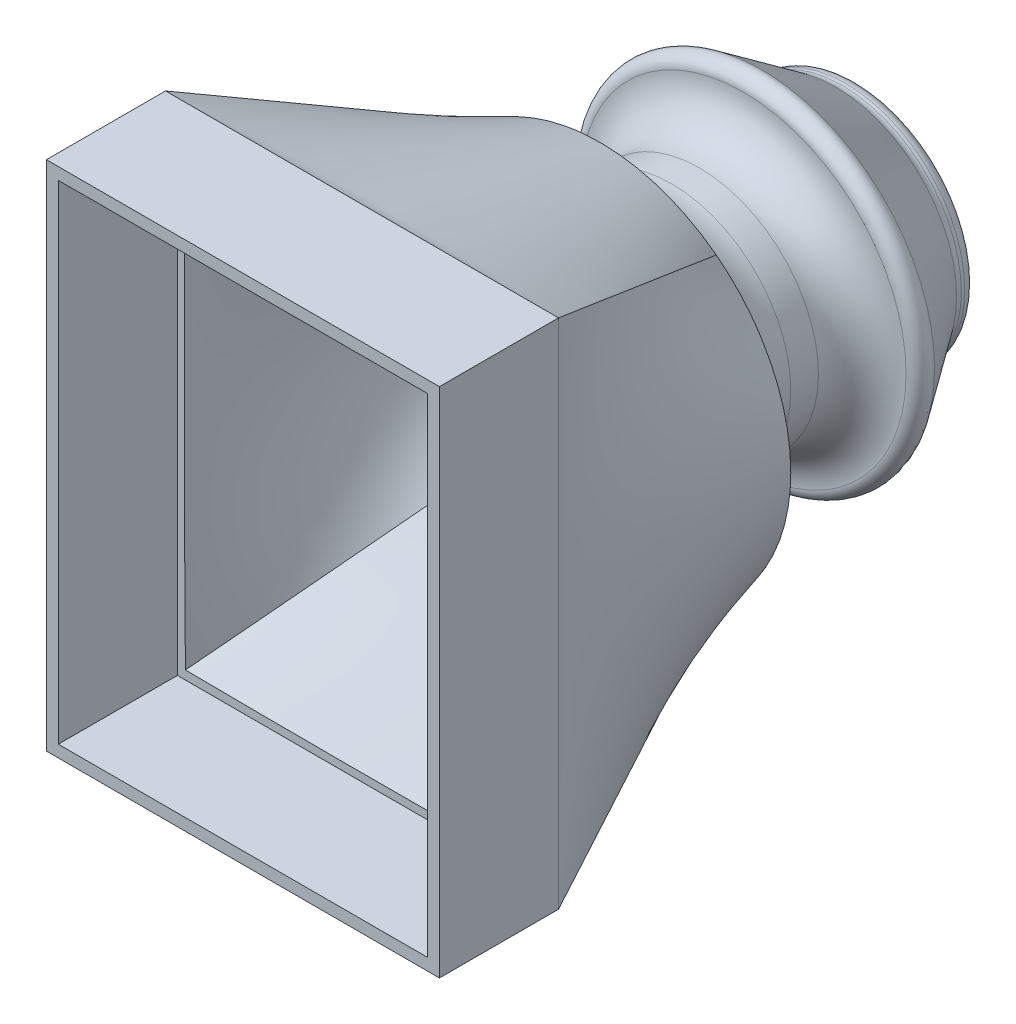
ISO-10303-21;
HEADER;
FILE_DESCRIPTION(('STEP AP214'),'2;1');
FILE_NAME('part.step','',(''),(''),'','','');
FILE_SCHEMA(('AUTOMOTIVE_DESIGN { 1 0 10303 214 1 1 1 1 }'));
ENDSEC;
DATA;
#1=APPLICATION_CONTEXT('core data for automotive mechanical design processes');
#2=APPLICATION_PROTOCOL_DEFINITION('international standard','automotive_design',2000,#1);
#3=PRODUCT_CONTEXT('',#1,'mechanical');
#4=PRODUCT('Part','Part','',(#3));
#5=PRODUCT_RELATED_PRODUCT_CATEGORY('part','',(#4));
#6=PRODUCT_DEFINITION_FORMATION('','',#4);
#7=PRODUCT_DEFINITION_CONTEXT('part definition',#1,'design');
#8=PRODUCT_DEFINITION('design','',#6,#7);
#9=PRODUCT_DEFINITION_SHAPE('','',#8);
#10=(LENGTH_UNIT() NAMED_UNIT(*) SI_UNIT(.MILLI.,.METRE.));
#11=(NAMED_UNIT(*) PLANE_ANGLE_UNIT() SI_UNIT($,.RADIAN.));
#12=(NAMED_UNIT(*) SI_UNIT($,.STERADIAN.) SOLID_ANGLE_UNIT());
#13=UNCERTAINTY_MEASURE_WITH_UNIT(LENGTH_MEASURE(1.E-05),#10,'distance_accuracy_value','');
#14=(GEOMETRIC_REPRESENTATION_CONTEXT(3) GLOBAL_UNCERTAINTY_ASSIGNED_CONTEXT((#13)) GLOBAL_UNIT_ASSIGNED_CONTEXT((#10,
#11,#12)) REPRESENTATION_CONTEXT('',''));
#15=CARTESIAN_POINT('',(0.,0.,0.));
#16=DIRECTION('',(0.,0.,1.));
#17=DIRECTION('',(1.,0.,0.));
#18=AXIS2_PLACEMENT_3D('',#15,#16,#17);
#19=CARTESIAN_POINT('',(0.,0.,0.));
#20=DIRECTION('',(0.,0.,1.));
#21=DIRECTION('',(1.,0.,0.));
#22=AXIS2_PLACEMENT_3D('',#19,#20,#21);
#23=CYLINDRICAL_SURFACE('',#22,4.2);
#24=CARTESIAN_POINT('',(0.,0.,-10.8));
#25=DIRECTION('',(0.,0.,1.));
#26=DIRECTION('',(1.,0.,0.));
#27=AXIS2_PLACEMENT_3D('',#24,#25,#26);
#28=CIRCLE('',#27,4.2);
#29=CARTESIAN_POINT('',(4.2,0.,-10.8));
#30=VERTEX_POINT('',#29);
#31=EDGE_CURVE('E12',#30,#30,#28,.T.);
#32=ORIENTED_EDGE('',*,*,#31,.F.);
#33=EDGE_LOOP('',(#32));
#34=FACE_BOUND('',#33,.T.);
#35=CARTESIAN_POINT('',(0.,0.,-9.35761111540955));
#36=DIRECTION('',(0.,0.,1.));
#37=DIRECTION('',(1.,0.,0.));
#38=AXIS2_PLACEMENT_3D('',#35,#36,#37);
#39=CIRCLE('',#38,4.2);
#40=CARTESIAN_POINT('',(4.2,0.,-9.35761111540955));
#41=VERTEX_POINT('',#40);
#42=EDGE_CURVE('E237',#41,#41,#39,.T.);
#43=ORIENTED_EDGE('',*,*,#42,.T.);
#44=EDGE_LOOP('',(#43));
#45=FACE_BOUND('',#44,.T.);
#46=ADVANCED_FACE('F89',(#34,#45),#23,.F.);
#47=CARTESIAN_POINT('',(-4.5,0.,-10.8));
#48=DIRECTION('',(0.,0.,1.));
#49=DIRECTION('',(1.,0.,0.));
#50=AXIS2_PLACEMENT_3D('',#47,#48,#49);
#51=PLANE('',#50);
#52=CARTESIAN_POINT('',(0.,0.,-10.8));
#53=DIRECTION('',(0.,0.,1.));
#54=DIRECTION('',(1.,0.,0.));
#55=AXIS2_PLACEMENT_3D('',#52,#53,#54);
#56=CIRCLE('',#55,4.5);
#57=CARTESIAN_POINT('',(4.5,0.,-10.8));
#58=VERTEX_POINT('',#57);
#59=EDGE_CURVE('E98',#58,#58,#56,.T.);
#60=ORIENTED_EDGE('',*,*,#59,.F.);
#61=EDGE_LOOP('',(#60));
#62=FACE_BOUND('',#61,.T.);
#63=ORIENTED_EDGE('',*,*,#31,.T.);
#64=EDGE_LOOP('',(#63));
#65=FACE_BOUND('',#64,.T.);
#66=ADVANCED_FACE('F477',(#62,#65),#51,.F.);
#67=CARTESIAN_POINT('',(0.,0.,-10.3));
#68=DIRECTION('',(0.,0.,1.));
#69=DIRECTION('',(1.,0.,0.));
#70=AXIS2_PLACEMENT_3D('',#67,#68,#69);
#71=TOROIDAL_SURFACE('',#70,4.5,0.5);
#72=CARTESIAN_POINT('',(0.,0.,-10.3));
#73=DIRECTION('',(0.,0.,1.));
#74=DIRECTION('',(1.,0.,0.));
#75=AXIS2_PLACEMENT_3D('',#72,#73,#74);
#76=CIRCLE('',#75,5.);
#77=CARTESIAN_POINT('',(5.,0.,-10.3));
#78=VERTEX_POINT('',#77);
#79=EDGE_CURVE('E469',#78,#78,#76,.T.);
#80=ORIENTED_EDGE('',*,*,#79,.F.);
#81=EDGE_LOOP('',(#80));
#82=FACE_BOUND('',#81,.T.);
#83=ORIENTED_EDGE('',*,*,#59,.T.);
#84=EDGE_LOOP('',(#83));
#85=FACE_BOUND('',#84,.T.);
#86=ADVANCED_FACE('F475',(#82,#85),#71,.T.);
#87=CARTESIAN_POINT('',(0.,0.,0.));
#88=DIRECTION('',(0.,0.,1.));
#89=DIRECTION('',(1.,0.,0.));
#90=AXIS2_PLACEMENT_3D('',#87,#88,#89);
#91=CYLINDRICAL_SURFACE('',#90,5.);
#92=CARTESIAN_POINT('',(0.,0.,-10.1576111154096));
#93=DIRECTION('',(0.,0.,1.));
#94=DIRECTION('',(1.,0.,0.));
#95=AXIS2_PLACEMENT_3D('',#92,#93,#94);
#96=CIRCLE('',#95,5.);
#97=CARTESIAN_POINT('',(5.,0.,-10.1576111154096));
#98=VERTEX_POINT('',#97);
#99=EDGE_CURVE('E466',#98,#98,#96,.T.);
#100=ORIENTED_EDGE('',*,*,#99,.F.);
#101=EDGE_LOOP('',(#100));
#102=FACE_BOUND('',#101,.T.);
#103=ORIENTED_EDGE('',*,*,#79,.T.);
#104=EDGE_LOOP('',(#103));
#105=FACE_BOUND('',#104,.T.);
#106=ADVANCED_FACE('F732',(#102,#105),#91,.T.);
#107=CARTESIAN_POINT('',(0.,0.,-10.1576111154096));
#108=DIRECTION('',(0.,0.,1.));
#109=DIRECTION('',(1.,0.,0.));
#110=AXIS2_PLACEMENT_3D('',#107,#108,#109);
#111=TOROIDAL_SURFACE('',#110,5.5,0.500000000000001);
#112=CARTESIAN_POINT('',(0.,0.,-9.87087994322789));
#113=DIRECTION('',(0.,0.,1.));
#114=DIRECTION('',(1.,0.,0.));
#115=AXIS2_PLACEMENT_3D('',#112,#113,#114);
#116=CIRCLE('',#115,5.09038403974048);
#117=CARTESIAN_POINT('',(5.09038403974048,0.,-9.87087994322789));
#118=VERTEX_POINT('',#117);
#119=EDGE_CURVE('E463',#118,#118,#116,.T.);
#120=ORIENTED_EDGE('',*,*,#119,.F.);
#121=EDGE_LOOP('',(#120));
#122=FACE_BOUND('',#121,.T.);
#123=ORIENTED_EDGE('',*,*,#99,.T.);
#124=EDGE_LOOP('',(#123));
#125=FACE_BOUND('',#124,.T.);
#126=ADVANCED_FACE('F740',(#122,#125),#111,.F.);
#127=CARTESIAN_POINT('',(0.,0.,-9.87087994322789));
#128=DIRECTION('',(0.,0.,1.));
#129=DIRECTION('',(1.,0.,0.));
#130=AXIS2_PLACEMENT_3D('',#127,#128,#129);
#131=CONICAL_SURFACE('',#130,5.09038403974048,0.610725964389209);
#132=CARTESIAN_POINT('',(0.,0.,-6.78673117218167));
#133=DIRECTION('',(0.,0.,1.));
#134=DIRECTION('',(1.,0.,0.));
#135=AXIS2_PLACEMENT_3D('',#132,#133,#134);
#136=CIRCLE('',#135,7.24928817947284);
#137=CARTESIAN_POINT('',(7.24928817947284,0.,-6.78673117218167));
#138=VERTEX_POINT('',#137);
#139=EDGE_CURVE('E460',#138,#138,#136,.T.);
#140=ORIENTED_EDGE('',*,*,#139,.F.);
#141=EDGE_LOOP('',(#140));
#142=FACE_BOUND('',#141,.T.);
#143=ORIENTED_EDGE('',*,*,#119,.T.);
#144=EDGE_LOOP('',(#143));
#145=FACE_BOUND('',#144,.T.);
#146=ADVANCED_FACE('F748',(#142,#145),#131,.T.);
#147=CARTESIAN_POINT('',(0.,0.,-6.5));
#148=DIRECTION('',(0.,0.,1.));
#149=DIRECTION('',(1.,0.,0.));
#150=AXIS2_PLACEMENT_3D('',#147,#148,#149);
#151=TOROIDAL_SURFACE('',#150,6.83967221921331,0.500000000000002);
#152=CARTESIAN_POINT('',(0.,0.,-6.));
#153=DIRECTION('',(0.,0.,1.));
#154=DIRECTION('',(1.,0.,0.));
#155=AXIS2_PLACEMENT_3D('',#152,#153,#154);
#156=CIRCLE('',#155,6.83967221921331);
#157=CARTESIAN_POINT('',(6.83967221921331,0.,-6.));
#158=VERTEX_POINT('',#157);
#159=EDGE_CURVE('E457',#158,#158,#156,.T.);
#160=ORIENTED_EDGE('',*,*,#159,.F.);
#161=EDGE_LOOP('',(#160));
#162=FACE_BOUND('',#161,.T.);
#163=ORIENTED_EDGE('',*,*,#139,.T.);
#164=EDGE_LOOP('',(#163));
#165=FACE_BOUND('',#164,.T.);
#166=ADVANCED_FACE('F756',(#162,#165),#151,.T.);
#167=CARTESIAN_POINT('',(0.,0.,-4.16032778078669));
#168=DIRECTION('',(0.,0.,1.));
#169=DIRECTION('',(1.,0.,0.));
#170=AXIS2_PLACEMENT_3D('',#167,#168,#169);
#171=TOROIDAL_SURFACE('',#170,6.83967221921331,1.83967221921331);
#172=CARTESIAN_POINT('',(0.,0.,-4.16032778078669));
#173=DIRECTION('',(0.,0.,1.));
#174=DIRECTION('',(1.,0.,0.));
#175=AXIS2_PLACEMENT_3D('',#172,#173,#174);
#176=CIRCLE('',#175,5.);
#177=CARTESIAN_POINT('',(5.,0.,-4.16032778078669));
#178=VERTEX_POINT('',#177);
#179=EDGE_CURVE('E454',#178,#178,#176,.T.);
#180=ORIENTED_EDGE('',*,*,#179,.F.);
#181=EDGE_LOOP('',(#180));
#182=FACE_BOUND('',#181,.T.);
#183=ORIENTED_EDGE('',*,*,#159,.T.);
#184=EDGE_LOOP('',(#183));
#185=FACE_BOUND('',#184,.T.);
#186=ADVANCED_FACE('F764',(#182,#185),#171,.F.);
#187=CARTESIAN_POINT('',(0.,0.,0.));
#188=DIRECTION('',(0.,0.,1.));
#189=DIRECTION('',(1.,0.,0.));
#190=AXIS2_PLACEMENT_3D('',#187,#188,#189);
#191=CYLINDRICAL_SURFACE('',#190,5.);
#192=CARTESIAN_POINT('',(0.,0.,-3.));
#193=DIRECTION('',(0.,0.,1.));
#194=DIRECTION('',(1.,0.,0.));
#195=AXIS2_PLACEMENT_3D('',#192,#193,#194);
#196=CIRCLE('',#195,5.);
#197=CARTESIAN_POINT('',(5.,0.,-3.));
#198=VERTEX_POINT('',#197);
#199=EDGE_CURVE('E314',#198,#198,#196,.T.);
#200=ORIENTED_EDGE('',*,*,#199,.F.);
#201=EDGE_LOOP('',(#200));
#202=FACE_BOUND('',#201,.T.);
#203=ORIENTED_EDGE('',*,*,#179,.T.);
#204=EDGE_LOOP('',(#203));
#205=FACE_BOUND('',#204,.T.);
#206=ADVANCED_FACE('F328',(#202,#205),#191,.T.);
#207=CARTESIAN_POINT('',(0.,0.,-3.));
#208=DIRECTION('',(0.,0.,1.));
#209=DIRECTION('',(1.,0.,0.));
#210=AXIS2_PLACEMENT_3D('',#207,#208,#209);
#211=TOROIDAL_SURFACE('',#210,8.,3.);
#212=CARTESIAN_POINT('',(4.87055026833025,6.34647461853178,0.));
#213=CARTESIAN_POINT('',(4.78114021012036,6.41508549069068,2.93264667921E-09));
#214=CARTESIAN_POINT('',(4.69026580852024,6.48176066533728,1.56318669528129E-09));
#215=CARTESIAN_POINT('',(4.50579996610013,6.61116293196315,-5.9264003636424E-09));
#216=CARTESIAN_POINT('',(4.41220958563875,6.67389153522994,-1.20446968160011E-08));
#217=CARTESIAN_POINT('',(4.12754516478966,6.85613974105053,-3.1752959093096E-08));
#218=CARTESIAN_POINT('',(3.93260757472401,6.96969898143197,-4.6694718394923E-08));
#219=CARTESIAN_POINT('',(3.53408129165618,7.18007293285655,-3.93314900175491E-08));
#220=CARTESIAN_POINT('',(3.33049764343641,7.27689724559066,-1.7047939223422E-08));
#221=CARTESIAN_POINT('',(2.91585250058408,7.45301348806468,4.14411836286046E-09));
#222=CARTESIAN_POINT('',(2.7047917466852,7.5323071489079,3.0549341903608E-09));
#223=CARTESIAN_POINT('',(2.38401075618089,7.63726047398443,-1.91029603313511E-09));
#224=CARTESIAN_POINT('',(2.27652337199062,7.66988141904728,-4.11575277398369E-09));
#225=CARTESIAN_POINT('',(2.06029400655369,7.73055920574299,-2.34157649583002E-08));
#226=CARTESIAN_POINT('',(1.95155230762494,7.75861705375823,-4.05070320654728E-08));
#227=CARTESIAN_POINT('',(1.62367232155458,7.83595823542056,-8.56872152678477E-08));
#228=CARTESIAN_POINT('',(1.40288602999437,7.87840696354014,-1.07681022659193E-07));
#229=CARTESIAN_POINT('',(0.958615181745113,7.94483926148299,-8.1330540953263E-08));
#230=CARTESIAN_POINT('',(0.735131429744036,7.96882820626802,-3.30067381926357E-08));
#231=CARTESIAN_POINT('',(0.39904600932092,7.99064091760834,-4.21622979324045E-09));
#232=CARTESIAN_POINT('',(0.286870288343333,7.99554996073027,-1.90261139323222E-09));
#233=CARTESIAN_POINT('',(0.0624122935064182,8.00054850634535,1.51668518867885E-09));
#234=CARTESIAN_POINT('',(-0.0498699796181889,8.00063804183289,2.62237164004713E-09));
#235=CARTESIAN_POINT('',(-0.386910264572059,7.99367371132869,-5.99529771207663E-09));
#236=CARTESIAN_POINT('',(-0.611557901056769,7.97936711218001,-2.7688643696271E-08));
#237=CARTESIAN_POINT('',(-1.05886755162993,7.93206383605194,-7.80441778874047E-08));
#238=CARTESIAN_POINT('',(-1.28152919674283,7.89906375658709,-1.06707634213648E-07));
#239=CARTESIAN_POINT('',(-1.72343202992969,7.8146765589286,-8.53172409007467E-08));
#240=CARTESIAN_POINT('',(-1.9426724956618,7.76328561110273,-3.52469887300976E-08));
#241=CARTESIAN_POINT('',(-2.26762888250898,7.67250908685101,-4.37569395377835E-09));
#242=CARTESIAN_POINT('',(-2.37529778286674,7.63996825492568,-1.4577591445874E-09));
#243=CARTESIAN_POINT('',(-2.58913324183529,7.57027933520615,1.3722741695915E-09));
#244=CARTESIAN_POINT('',(-2.69529984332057,7.53313137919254,1.28445863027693E-09));
#245=CARTESIAN_POINT('',(-2.98605350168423,7.42437149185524,-2.64416897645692E-09));
#246=CARTESIAN_POINT('',(-3.16889294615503,7.34803031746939,-9.28764092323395E-09));
#247=CARTESIAN_POINT('',(-3.52842294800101,7.18207002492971,-3.06188352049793E-08));
#248=CARTESIAN_POINT('',(-3.70511334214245,7.09245055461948,-4.53067709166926E-08));
#249=CARTESIAN_POINT('',(-4.05137091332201,6.9005450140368,-4.34664020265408E-08));
#250=CARTESIAN_POINT('',(-4.22094154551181,6.79826518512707,-2.69534221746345E-08));
#251=CARTESIAN_POINT('',(-4.55203028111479,6.58145201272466,1.93822011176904E-10));
#252=CARTESIAN_POINT('',(-4.71354925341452,6.46691999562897,1.0828721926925E-08));
#253=CARTESIAN_POINT('',(-4.87055026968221,6.34647461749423,0.));
#254=B_SPLINE_CURVE_WITH_KNOTS('',3,(#212,#213,#214,#215,#216,#217,#218,#219,#220,#221,#222,
#223,#224,#225,#226,#227,#228,#229,#230,#231,#232,#233,#234,#235,#236,#237,#238,#239,#240,#241,
#242,#243,#244,#245,#246,#247,#248,#249,#250,#251,#252,#253),.UNSPECIFIED.,.F.,.F.,(4,2,2,2,2,2,
2,2,2,2,2,2,2,2,2,2,2,2,2,2,4),(0.,0.338046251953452,0.675962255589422,1.35190622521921,
2.02746107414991,2.70294918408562,3.03984616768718,3.37666874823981,4.05033556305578,
4.72380615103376,5.06056506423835,5.3973216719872,6.07174527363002,6.74629166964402,
7.4209786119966,7.75832733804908,8.09566641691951,8.68948616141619,9.28332165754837,
9.87686555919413,10.470345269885),.UNSPECIFIED.);
#255=CARTESIAN_POINT('',(4.87055026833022,6.34647461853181,0.));
#256=VERTEX_POINT('',#255);
#257=CARTESIAN_POINT('',(-4.87055026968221,6.34647461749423,0.));
#258=VERTEX_POINT('',#257);
#259=EDGE_CURVE('E306',#256,#258,#254,.T.);
#260=ORIENTED_EDGE('',*,*,#259,.F.);
#261=CARTESIAN_POINT('',(4.87055026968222,-6.34647461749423,0.));
#262=CARTESIAN_POINT('',(5.04906984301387,-6.20946536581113,-3.60759987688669E-10));
#263=CARTESIAN_POINT('',(5.22182036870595,-6.06486552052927,-4.55012181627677E-10));
#264=CARTESIAN_POINT('',(5.55454539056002,-5.76166129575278,-3.80672493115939E-10));
#265=CARTESIAN_POINT('',(5.7145205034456,-5.60305759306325,-2.12093306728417E-10));
#266=CARTESIAN_POINT('',(5.94395463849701,-5.35555466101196,3.52586351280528E-11));
#267=CARTESIAN_POINT('',(6.0186637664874,-5.27147224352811,1.16773749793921E-10));
#268=CARTESIAN_POINT('',(6.1644448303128,-5.10021224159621,3.31127575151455E-11));
#269=CARTESIAN_POINT('',(6.23551677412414,-5.01303466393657,-1.32062808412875E-10));
#270=CARTESIAN_POINT('',(6.44311643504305,-4.74713535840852,-1.03985814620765E-09));
#271=CARTESIAN_POINT('',(6.57406447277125,-4.56400765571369,-2.19462889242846E-09));
#272=CARTESIAN_POINT('',(6.82020100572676,-4.1873800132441,-1.64224985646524E-09));
#273=CARTESIAN_POINT('',(6.93538348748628,-3.99387615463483,6.59886932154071E-11));
#274=CARTESIAN_POINT('',(7.14888954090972,-3.5977659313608,-7.00611327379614E-11));
#275=CARTESIAN_POINT('',(7.24721281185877,-3.39515940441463,-1.91441286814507E-09));
#276=CARTESIAN_POINT('',(7.42647999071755,-2.98246722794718,-4.13012141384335E-09));
#277=CARTESIAN_POINT('',(7.50742804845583,-2.77238337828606,-4.50183031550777E-09));
#278=CARTESIAN_POINT('',(7.65144443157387,-2.34616837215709,-2.1092857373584E-09));
#279=CARTESIAN_POINT('',(7.71451306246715,-2.13003731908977,6.5491415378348E-10));
#280=CARTESIAN_POINT('',(7.82195365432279,-1.69333047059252,-6.54174960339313E-10));
#281=CARTESIAN_POINT('',(7.86633802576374,-1.47275772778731,-4.72291639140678E-09));
#282=CARTESIAN_POINT('',(7.93652819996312,-1.02868303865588,-7.41609666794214E-09));
#283=CARTESIAN_POINT('',(7.96233381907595,-0.805181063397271,-6.04048169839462E-09));
#284=CARTESIAN_POINT('',(7.99511160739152,-0.356751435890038,-1.85287776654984E-09));
#285=CARTESIAN_POINT('',(8.00208077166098,-0.131823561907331,9.59340288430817E-10));
#286=CARTESIAN_POINT('',(7.99682409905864,0.317797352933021,-9.76312597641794E-10));
#287=CARTESIAN_POINT('',(7.98459825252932,0.542490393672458,-5.72418734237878E-09));
#288=CARTESIAN_POINT('',(7.9414299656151,0.990065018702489,-7.81702548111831E-09));
#289=CARTESIAN_POINT('',(7.91048984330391,1.21294682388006,-5.16290558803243E-09));
#290=CARTESIAN_POINT('',(7.85016059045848,1.54468055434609,-1.66691165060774E-09));
#291=CARTESIAN_POINT('',(7.82772833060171,1.65483683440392,-5.82368357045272E-10));
#292=CARTESIAN_POINT('',(7.77819891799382,1.87409533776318,5.14557526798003E-10));
#293=CARTESIAN_POINT('',(7.75110182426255,1.98319757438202,5.26953680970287E-10));
#294=CARTESIAN_POINT('',(7.66289126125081,2.30865227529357,-1.16610669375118E-09));
#295=CARTESIAN_POINT('',(7.59485625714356,2.52316512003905,-4.6016174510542E-09));
#296=CARTESIAN_POINT('',(7.44109910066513,2.94574763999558,-5.31682467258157E-09));
#297=CARTESIAN_POINT('',(7.35537721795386,3.15381741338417,-2.59661498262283E-09));
#298=CARTESIAN_POINT('',(7.21381206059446,3.4601755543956,-4.33030698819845E-10));
#299=CARTESIAN_POINT('',(7.1643858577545,3.56146749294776,-3.20358486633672E-11));
#300=CARTESIAN_POINT('',(7.06125511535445,3.76184659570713,2.74159552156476E-10));
#301=CARTESIAN_POINT('',(7.00755064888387,3.8609337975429,1.79368570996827E-10));
#302=CARTESIAN_POINT('',(6.84020941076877,4.15466320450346,-7.50596420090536E-10));
#303=CARTESIAN_POINT('',(6.7203339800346,4.34579659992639,-2.23123690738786E-09));
#304=CARTESIAN_POINT('',(6.46511077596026,4.71713382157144,-2.15154014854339E-09));
#305=CARTESIAN_POINT('',(6.32977786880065,4.8973478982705,-5.94101963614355E-10));
#306=CARTESIAN_POINT('',(6.0443758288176,5.24559684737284,5.13812471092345E-10));
#307=CARTESIAN_POINT('',(5.89431276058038,5.41363668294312,6.5111311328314E-11));
#308=CARTESIAN_POINT('',(5.60239981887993,5.71400882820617,-4.08954975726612E-10));
#309=CARTESIAN_POINT('',(5.46231196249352,5.84805637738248,-4.84532594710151E-10));
#310=CARTESIAN_POINT('',(5.24534514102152,6.0411150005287,-2.74930321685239E-10));
#311=CARTESIAN_POINT('',(5.17195323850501,6.10407902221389,-1.51492266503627E-10));
#312=CARTESIAN_POINT('',(5.02291755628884,6.22731806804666,2.32651110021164E-11));
#313=CARTESIAN_POINT('',(4.94727327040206,6.28759248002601,7.45680952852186E-11));
#314=CARTESIAN_POINT('',(4.87055026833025,6.34647461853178,0.));
#315=B_SPLINE_CURVE_WITH_KNOTS('',3,(#261,#262,#263,#264,#265,#266,#267,#268,#269,#270,#271,
#272,#273,#274,#275,#276,#277,#278,#279,#280,#281,#282,#283,#284,#285,#286,#287,#288,#289,#290,
#291,#292,#293,#294,#295,#296,#297,#298,#299,#300,#301,#302,#303,#304,#305,#306,#307,#308,#309,
#310,#311,#312,#313,#314),.UNSPECIFIED.,.F.,.F.,(4,2,2,2,2,2,2,2,2,2,2,2,2,2,2,2,2,2,2,2,2,2,2,
2,2,2,4),(0.,0.67499837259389,1.34996414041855,1.68730947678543,2.02465407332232,
2.69918267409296,3.3739678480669,4.04876505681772,4.72340091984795,5.39802525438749,
6.07220077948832,6.74638296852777,7.42067270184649,8.09496277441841,8.76916934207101,
9.10633374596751,9.44349388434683,10.1177765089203,10.7920488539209,11.1300815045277,
11.46810838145,12.1440850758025,12.8194170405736,13.4944721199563,14.0756083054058,
14.3656515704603,14.6557605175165),.UNSPECIFIED.);
#316=CARTESIAN_POINT('',(4.87055026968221,-6.34647461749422,0.));
#317=VERTEX_POINT('',#316);
#318=EDGE_CURVE('E316',#317,#256,#315,.T.);
#319=ORIENTED_EDGE('',*,*,#318,.F.);
#320=CARTESIAN_POINT('',(-4.87055026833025,-6.34647461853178,0.));
#321=CARTESIAN_POINT('',(-4.78114021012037,-6.41508549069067,2.93264667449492E-09));
#322=CARTESIAN_POINT('',(-4.69026580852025,-6.48176066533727,1.56318669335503E-09));
#323=CARTESIAN_POINT('',(-4.50579996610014,-6.61116293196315,-5.92640036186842E-09));
#324=CARTESIAN_POINT('',(-4.41220958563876,-6.67389153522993,-1.20446968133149E-08));
#325=CARTESIAN_POINT('',(-4.12754516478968,-6.85613974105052,-3.17529590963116E-08));
#326=CARTESIAN_POINT('',(-3.93260757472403,-6.96969898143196,-4.66947184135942E-08));
#327=CARTESIAN_POINT('',(-3.53408129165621,-7.18007293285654,-3.93314899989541E-08));
#328=CARTESIAN_POINT('',(-3.33049764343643,-7.27689724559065,-1.70479391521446E-08));
#329=CARTESIAN_POINT('',(-2.91585250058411,-7.45301348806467,4.14411829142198E-09));
#330=CARTESIAN_POINT('',(-2.70479174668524,-7.53230714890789,3.05493392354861E-09));
#331=CARTESIAN_POINT('',(-2.38401075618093,-7.63726047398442,-1.91029618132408E-09));
#332=CARTESIAN_POINT('',(-2.27652337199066,-7.66988141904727,-4.1157528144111E-09));
#333=CARTESIAN_POINT('',(-2.06029400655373,-7.73055920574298,-2.3415764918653E-08));
#334=CARTESIAN_POINT('',(-1.95155230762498,-7.75861705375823,-4.05070320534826E-08));
#335=CARTESIAN_POINT('',(-1.62367232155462,-7.83595823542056,-8.56872152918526E-08));
#336=CARTESIAN_POINT('',(-1.4028860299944,-7.87840696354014,-1.07681022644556E-07));
#337=CARTESIAN_POINT('',(-0.958615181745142,-7.94483926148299,-8.1330540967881E-08));
#338=CARTESIAN_POINT('',(-0.735131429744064,-7.96882820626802,-3.30067382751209E-08));
#339=CARTESIAN_POINT('',(-0.399046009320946,-7.99064091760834,-4.21622975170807E-09));
#340=CARTESIAN_POINT('',(-0.286870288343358,-7.99554996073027,-1.9026112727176E-09));
#341=CARTESIAN_POINT('',(-0.0624122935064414,-8.00054850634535,1.51668506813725E-09));
#342=CARTESIAN_POINT('',(0.0498699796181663,-8.00063804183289,2.62237119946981E-09));
#343=CARTESIAN_POINT('',(0.386910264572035,-7.99367371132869,-5.9952984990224E-09));
#344=CARTESIAN_POINT('',(0.611557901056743,-7.97936711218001,-2.76886438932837E-08));
#345=CARTESIAN_POINT('',(1.0588675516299,-7.93206383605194,-7.80441776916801E-08));
#346=CARTESIAN_POINT('',(1.2815291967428,-7.8990637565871,-1.06707634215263E-07));
#347=CARTESIAN_POINT('',(1.72343202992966,-7.8146765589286,-8.53172408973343E-08));
#348=CARTESIAN_POINT('',(1.94267249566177,-7.76328561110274,-3.52469885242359E-08));
#349=CARTESIAN_POINT('',(2.26762888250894,-7.67250908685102,-4.37569405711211E-09));
#350=CARTESIAN_POINT('',(2.37529778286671,-7.63996825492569,-1.45775945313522E-09));
#351=CARTESIAN_POINT('',(2.58913324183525,-7.57027933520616,1.37227361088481E-09));
#352=CARTESIAN_POINT('',(2.69529984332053,-7.53313137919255,1.28445802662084E-09));
#353=CARTESIAN_POINT('',(2.98605350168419,-7.42437149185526,-2.64416945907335E-09));
#354=CARTESIAN_POINT('',(3.168892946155,-7.3480303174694,-9.28764105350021E-09));
#355=CARTESIAN_POINT('',(3.52842294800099,-7.18207002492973,-3.06188350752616E-08));
#356=CARTESIAN_POINT('',(3.70511334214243,-7.09245055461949,-4.5306770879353E-08));
#357=CARTESIAN_POINT('',(4.05137091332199,-6.90054501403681,-4.34664020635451E-08));
#358=CARTESIAN_POINT('',(4.2209415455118,-6.79826518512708,-2.69534221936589E-08));
#359=CARTESIAN_POINT('',(4.55203028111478,-6.58145201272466,1.93822030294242E-10));
#360=CARTESIAN_POINT('',(4.71354925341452,-6.46691999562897,1.08287219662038E-08));
#361=CARTESIAN_POINT('',(4.87055026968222,-6.34647461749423,0.));
#362=B_SPLINE_CURVE_WITH_KNOTS('',3,(#320,#321,#322,#323,#324,#325,#326,#327,#328,#329,#330,
#331,#332,#333,#334,#335,#336,#337,#338,#339,#340,#341,#342,#343,#344,#345,#346,#347,#348,#349,
#350,#351,#352,#353,#354,#355,#356,#357,#358,#359,#360,#361),.UNSPECIFIED.,.F.,.F.,(4,2,2,2,2,2,
2,2,2,2,2,2,2,2,2,2,2,2,2,2,4),(0.,0.338046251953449,0.675962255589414,1.35190622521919,
2.02746107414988,2.70294918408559,3.03984616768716,3.37666874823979,4.05033556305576,
4.72380615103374,5.06056506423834,5.39732167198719,6.07174527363,6.746291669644,
7.42097861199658,7.75832733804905,8.09566641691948,8.68948616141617,9.28332165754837,
9.87686555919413,10.470345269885),.UNSPECIFIED.);
#363=CARTESIAN_POINT('',(-4.87055026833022,-6.3464746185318,0.));
#364=VERTEX_POINT('',#363);
#365=EDGE_CURVE('E340',#364,#317,#362,.T.);
#366=ORIENTED_EDGE('',*,*,#365,.F.);
#367=CARTESIAN_POINT('',(-4.87055026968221,6.34647461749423,0.));
#368=CARTESIAN_POINT('',(-5.04906984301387,6.20946536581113,-3.607599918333E-10));
#369=CARTESIAN_POINT('',(-5.22182036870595,6.06486552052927,-4.55012183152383E-10));
#370=CARTESIAN_POINT('',(-5.55454539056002,5.76166129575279,-3.80672491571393E-10));
#371=CARTESIAN_POINT('',(-5.71452050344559,5.60305759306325,-2.1209330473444E-10));
#372=CARTESIAN_POINT('',(-5.94395463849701,5.35555466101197,3.5258634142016E-11));
#373=CARTESIAN_POINT('',(-6.0186637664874,5.27147224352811,1.16773747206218E-10));
#374=CARTESIAN_POINT('',(-6.1644448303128,5.10021224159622,3.31127601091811E-11));
#375=CARTESIAN_POINT('',(-6.23551677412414,5.01303466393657,-1.32062799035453E-10));
#376=CARTESIAN_POINT('',(-6.44311643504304,4.74713535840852,-1.03985816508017E-09));
#377=CARTESIAN_POINT('',(-6.57406447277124,4.56400765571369,-2.19462899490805E-09));
#378=CARTESIAN_POINT('',(-6.82020100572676,4.1873800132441,-1.64224996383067E-09));
#379=CARTESIAN_POINT('',(-6.93538348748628,3.99387615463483,6.59886646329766E-11));
#380=CARTESIAN_POINT('',(-7.14888954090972,3.5977659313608,-7.00611041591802E-11));
#381=CARTESIAN_POINT('',(-7.24721281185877,3.39515940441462,-1.91441286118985E-09));
#382=CARTESIAN_POINT('',(-7.42647999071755,2.98246722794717,-4.13012142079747E-09));
#383=CARTESIAN_POINT('',(-7.50742804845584,2.77238337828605,-4.50183031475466E-09));
#384=CARTESIAN_POINT('',(-7.65144443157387,2.34616837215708,-2.10928573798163E-09));
#385=CARTESIAN_POINT('',(-7.71451306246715,2.13003731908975,6.54914144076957E-10));
#386=CARTESIAN_POINT('',(-7.82195365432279,1.69333047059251,-6.54174971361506E-10));
#387=CARTESIAN_POINT('',(-7.86633802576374,1.4727577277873,-4.72291639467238E-09));
#388=CARTESIAN_POINT('',(-7.93652819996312,1.02868303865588,-7.41609666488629E-09));
#389=CARTESIAN_POINT('',(-7.96233381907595,0.805181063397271,-6.040481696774E-09));
#390=CARTESIAN_POINT('',(-7.99511160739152,0.356751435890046,-1.85287776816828E-09));
#391=CARTESIAN_POINT('',(-8.00208077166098,0.131823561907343,9.59340285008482E-10));
#392=CARTESIAN_POINT('',(-7.99682409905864,-0.317797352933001,-9.76312594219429E-10));
#393=CARTESIAN_POINT('',(-7.98459825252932,-0.542490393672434,-5.72418733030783E-09));
#394=CARTESIAN_POINT('',(-7.9414299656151,-0.990065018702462,-7.81702546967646E-09));
#395=CARTESIAN_POINT('',(-7.91048984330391,-1.21294682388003,-5.16290558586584E-09));
#396=CARTESIAN_POINT('',(-7.85016059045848,-1.54468055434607,-1.66691165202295E-09));
#397=CARTESIAN_POINT('',(-7.82772833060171,-1.6548368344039,-5.8236835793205E-10));
#398=CARTESIAN_POINT('',(-7.77819891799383,-1.87409533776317,5.14557527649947E-10));
#399=CARTESIAN_POINT('',(-7.75110182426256,-1.983197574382,5.26953683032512E-10));
#400=CARTESIAN_POINT('',(-7.66289126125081,-2.30865227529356,-1.16610669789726E-09));
#401=CARTESIAN_POINT('',(-7.59485625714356,-2.52316512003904,-4.60161747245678E-09));
#402=CARTESIAN_POINT('',(-7.44109910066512,-2.94574763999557,-5.31682465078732E-09));
#403=CARTESIAN_POINT('',(-7.35537721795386,-3.15381741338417,-2.59661490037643E-09));
#404=CARTESIAN_POINT('',(-7.21381206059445,-3.4601755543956,-4.33030652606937E-10));
#405=CARTESIAN_POINT('',(-7.1643858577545,-3.56146749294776,-3.20358357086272E-11));
#406=CARTESIAN_POINT('',(-7.06125511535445,-3.76184659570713,2.74159539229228E-10));
#407=CARTESIAN_POINT('',(-7.00755064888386,-3.8609337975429,1.79368565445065E-10));
#408=CARTESIAN_POINT('',(-6.84020941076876,-4.15466320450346,-7.50596408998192E-10));
#409=CARTESIAN_POINT('',(-6.72033398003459,-4.34579659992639,-2.23123689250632E-09));
#410=CARTESIAN_POINT('',(-6.46511077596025,-4.71713382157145,-2.15154016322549E-09));
#411=CARTESIAN_POINT('',(-6.32977786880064,-4.89734789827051,-5.94102011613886E-10));
#412=CARTESIAN_POINT('',(-6.04437582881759,-5.24559684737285,5.1381251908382E-10));
#413=CARTESIAN_POINT('',(-5.89431276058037,-5.41363668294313,6.51114885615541E-11));
#414=CARTESIAN_POINT('',(-5.60239981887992,-5.71400882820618,-4.08954826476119E-10));
#415=CARTESIAN_POINT('',(-5.46231196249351,-5.84805637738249,-4.84532565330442E-10));
#416=CARTESIAN_POINT('',(-5.24534514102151,-6.0411150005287,-2.74930336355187E-10));
#417=CARTESIAN_POINT('',(-5.17195323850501,-6.1040790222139,-1.51492273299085E-10));
#418=CARTESIAN_POINT('',(-5.02291755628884,-6.22731806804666,2.32651177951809E-11));
#419=CARTESIAN_POINT('',(-4.94727327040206,-6.28759248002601,7.45681077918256E-11));
#420=CARTESIAN_POINT('',(-4.87055026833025,-6.34647461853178,0.));
#421=B_SPLINE_CURVE_WITH_KNOTS('',3,(#367,#368,#369,#370,#371,#372,#373,#374,#375,#376,#377,
#378,#379,#380,#381,#382,#383,#384,#385,#386,#387,#388,#389,#390,#391,#392,#393,#394,#395,#396,
#397,#398,#399,#400,#401,#402,#403,#404,#405,#406,#407,#408,#409,#410,#411,#412,#413,#414,#415,
#416,#417,#418,#419,#420),.UNSPECIFIED.,.F.,.F.,(4,2,2,2,2,2,2,2,2,2,2,2,2,2,2,2,2,2,2,2,2,2,2,
2,2,2,4),(0.,0.674998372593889,1.34996414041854,1.68730947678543,2.02465407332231,
2.69918267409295,3.37396784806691,4.04876505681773,4.72340091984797,5.39802525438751,
6.07220077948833,6.74638296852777,7.42067270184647,8.09496277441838,8.76916934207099,
9.1063337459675,9.44349388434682,10.1177765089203,10.7920488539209,11.1300815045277,
11.46810838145,12.1440850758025,12.8194170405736,13.4944721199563,14.0756083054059,
14.3656515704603,14.6557605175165),.UNSPECIFIED.);
#422=EDGE_CURVE('E336',#258,#364,#421,.T.);
#423=ORIENTED_EDGE('',*,*,#422,.F.);
#424=EDGE_LOOP('',(#260,#319,#366,#423));
#425=FACE_BOUND('',#424,.T.);
#426=ORIENTED_EDGE('',*,*,#199,.T.);
#427=EDGE_LOOP('',(#426));
#428=FACE_BOUND('',#427,.T.);
#429=ADVANCED_FACE('F323',(#425,#428),#211,.F.);
#430=CARTESIAN_POINT('',(0.,0.,10.));
#431=DIRECTION('',(0.,0.,1.));
#432=DIRECTION('',(1.,0.,0.));
#433=AXIS2_PLACEMENT_3D('',#430,#431,#432);
#434=PLANE('',#433);
#435=DIRECTION('',(-1.,0.,0.));
#436=VECTOR('',#435,1.);
#437=CARTESIAN_POINT('',(8.24999999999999,10.25,10.));
#438=LINE('',#437,#436);
#439=CARTESIAN_POINT('',(7.74999999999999,10.25,10.));
#440=VERTEX_POINT('',#439);
#441=CARTESIAN_POINT('',(-7.75000000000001,10.25,10.));
#442=VERTEX_POINT('',#441);
#443=EDGE_CURVE('E106',#440,#442,#438,.T.);
#444=ORIENTED_EDGE('',*,*,#443,.T.);
#445=DIRECTION('',(0.,-1.,0.));
#446=VECTOR('',#445,1.);
#447=CARTESIAN_POINT('',(-7.75000000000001,10.75,10.));
#448=LINE('',#447,#446);
#449=CARTESIAN_POINT('',(-7.75,-10.25,10.));
#450=VERTEX_POINT('',#449);
#451=EDGE_CURVE('E110',#442,#450,#448,.T.);
#452=ORIENTED_EDGE('',*,*,#451,.T.);
#453=DIRECTION('',(1.,0.,0.));
#454=VECTOR('',#453,1.);
#455=CARTESIAN_POINT('',(-8.25,-10.25,10.));
#456=LINE('',#455,#454);
#457=CARTESIAN_POINT('',(7.75,-10.25,10.));
#458=VERTEX_POINT('',#457);
#459=EDGE_CURVE('E220',#450,#458,#456,.T.);
#460=ORIENTED_EDGE('',*,*,#459,.T.);
#461=DIRECTION('',(0.,1.,0.));
#462=VECTOR('',#461,1.);
#463=CARTESIAN_POINT('',(7.75,-10.75,10.));
#464=LINE('',#463,#462);
#465=EDGE_CURVE('E201',#458,#440,#464,.T.);
#466=ORIENTED_EDGE('',*,*,#465,.T.);
#467=EDGE_LOOP('',(#444,#452,#460,#466));
#468=FACE_BOUND('',#467,.T.);
#469=CARTESIAN_POINT('',(-7.41427163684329,9.88399660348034,10.));
#470=CARTESIAN_POINT('',(-7.41869201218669,9.48064899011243,10.));
#471=CARTESIAN_POINT('',(-7.42260843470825,9.07729600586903,10.));
#472=CARTESIAN_POINT('',(-7.42949644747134,8.27058270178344,10.));
#473=CARTESIAN_POINT('',(-7.43246803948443,7.86722238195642,10.));
#474=CARTESIAN_POINT('',(-7.43752946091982,7.0604994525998,10.));
#475=CARTESIAN_POINT('',(-7.43961929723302,6.65713684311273,10.));
#476=CARTESIAN_POINT('',(-7.44305388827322,5.85040835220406,10.));
#477=CARTESIAN_POINT('',(-7.44439864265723,5.44704247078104,10.));
#478=CARTESIAN_POINT('',(-7.44757400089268,4.23695338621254,10.));
#479=CARTESIAN_POINT('',(-7.44854575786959,3.43022811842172,10.));
#480=CARTESIAN_POINT('',(-7.44962035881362,1.81677448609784,10.));
#481=CARTESIAN_POINT('',(-7.4497231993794,1.01004612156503,10.));
#482=CARTESIAN_POINT('',(-7.44977223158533,-0.637296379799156,10.));
#483=CARTESIAN_POINT('',(-7.4497116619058,-1.47791051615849,10.));
#484=CARTESIAN_POINT('',(-7.44881425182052,-3.15913571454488,10.));
#485=CARTESIAN_POINT('',(-7.44797741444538,-3.99974677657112,10.));
#486=CARTESIAN_POINT('',(-7.44496068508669,-5.2606646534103,10.));
#487=CARTESIAN_POINT('',(-7.44366151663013,-5.68097335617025,10.));
#488=CARTESIAN_POINT('',(-7.44027527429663,-6.52158746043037,10.));
#489=CARTESIAN_POINT('',(-7.4381882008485,-6.94189286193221,10.));
#490=CARTESIAN_POINT('',(-7.43306607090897,-7.78250283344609,10.));
#491=CARTESIAN_POINT('',(-7.43003100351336,-8.20280740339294,10.));
#492=CARTESIAN_POINT('',(-7.42293759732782,-9.04340879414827,10.));
#493=CARTESIAN_POINT('',(-7.41887925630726,-9.46370561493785,10.));
#494=CARTESIAN_POINT('',(-7.41427163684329,-9.88399660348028,10.));
#495=B_SPLINE_CURVE_WITH_KNOTS('',3,(#469,#470,#471,#472,#473,#474,#475,#476,#477,#478,#479,
#480,#481,#482,#483,#484,#485,#486,#487,#488,#489,#490,#491,#492,#493,#494),.UNSPECIFIED.,.F.,
.F.,(4,2,2,2,2,2,2,2,2,2,2,2,4),(0.,1.21011497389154,2.42022767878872,3.63033092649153,
4.84043473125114,7.26061046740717,9.68079567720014,12.2026382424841,14.7244709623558,
15.9854025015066,17.2463333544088,18.5072787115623,19.7682268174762),.UNSPECIFIED.);
#496=CARTESIAN_POINT('',(-7.41427163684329,9.88399660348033,10.));
#497=VERTEX_POINT('',#496);
#498=CARTESIAN_POINT('',(-7.41427163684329,-9.88399660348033,10.));
#499=VERTEX_POINT('',#498);
#500=EDGE_CURVE('E598',#497,#499,#495,.T.);
#501=ORIENTED_EDGE('',*,*,#500,.F.);
#502=CARTESIAN_POINT('',(7.41427163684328,9.88399660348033,10.));
#503=CARTESIAN_POINT('',(6.45526600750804,9.89422974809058,10.));
#504=CARTESIAN_POINT('',(5.49623775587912,9.90195030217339,10.));
#505=CARTESIAN_POINT('',(3.57815600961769,9.91322116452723,10.));
#506=CARTESIAN_POINT('',(2.61910251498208,9.91677147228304,10.));
#507=CARTESIAN_POINT('',(0.903857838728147,9.92015642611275,10.));
#508=CARTESIAN_POINT('',(0.147667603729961,9.92061818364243,10.));
#509=CARTESIAN_POINT('',(-1.36471128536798,9.91954331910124,10.));
#510=CARTESIAN_POINT('',(-2.12089993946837,9.91800669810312,10.));
#511=CARTESIAN_POINT('',(-3.63329726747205,9.91266996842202,10.));
#512=CARTESIAN_POINT('',(-4.38950594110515,9.90886977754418,10.));
#513=CARTESIAN_POINT('',(-5.901905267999,9.89856834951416,10.));
#514=CARTESIAN_POINT('',(-6.65809592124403,9.89206711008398,10.));
#515=CARTESIAN_POINT('',(-7.41427163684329,9.88399660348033,10.));
#516=B_SPLINE_CURVE_WITH_KNOTS('',3,(#502,#503,#504,#505,#506,#507,#508,#509,#510,#511,#512,
#513,#514,#515),.UNSPECIFIED.,.F.,.F.,(4,2,2,2,2,2,4),(0.,2.87717139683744,5.75434314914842,
8.0229121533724,10.291479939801,12.5601301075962,14.8287821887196),.UNSPECIFIED.);
#517=CARTESIAN_POINT('',(7.41427163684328,9.88399660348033,10.));
#518=VERTEX_POINT('',#517);
#519=EDGE_CURVE('E260',#518,#497,#516,.T.);
#520=ORIENTED_EDGE('',*,*,#519,.F.);
#521=CARTESIAN_POINT('',(7.41427163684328,-9.88399660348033,10.));
#522=CARTESIAN_POINT('',(7.41869201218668,-9.48064899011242,10.));
#523=CARTESIAN_POINT('',(7.42260843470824,-9.07729600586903,10.));
#524=CARTESIAN_POINT('',(7.42949644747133,-8.27058270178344,10.));
#525=CARTESIAN_POINT('',(7.43246803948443,-7.86722238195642,10.));
#526=CARTESIAN_POINT('',(7.43752946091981,-7.0604994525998,10.));
#527=CARTESIAN_POINT('',(7.43961929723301,-6.65713684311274,10.));
#528=CARTESIAN_POINT('',(7.44305388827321,-5.85040835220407,10.));
#529=CARTESIAN_POINT('',(7.44439864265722,-5.44704247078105,10.));
#530=CARTESIAN_POINT('',(7.44757400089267,-4.23695338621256,10.));
#531=CARTESIAN_POINT('',(7.44854575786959,-3.43022811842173,10.));
#532=CARTESIAN_POINT('',(7.44962035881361,-1.81677448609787,10.));
#533=CARTESIAN_POINT('',(7.44972319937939,-1.01004612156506,10.));
#534=CARTESIAN_POINT('',(7.44977223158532,0.637296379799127,10.));
#535=CARTESIAN_POINT('',(7.44971166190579,1.47791051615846,10.));
#536=CARTESIAN_POINT('',(7.44881425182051,3.15913571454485,10.));
#537=CARTESIAN_POINT('',(7.44797741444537,3.9997467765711,10.));
#538=CARTESIAN_POINT('',(7.44496068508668,5.26066465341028,10.));
#539=CARTESIAN_POINT('',(7.44366151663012,5.68097335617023,10.));
#540=CARTESIAN_POINT('',(7.44027527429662,6.52158746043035,10.));
#541=CARTESIAN_POINT('',(7.4381882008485,6.9418928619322,10.));
#542=CARTESIAN_POINT('',(7.43306607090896,7.78250283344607,10.));
#543=CARTESIAN_POINT('',(7.43003100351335,8.20280740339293,10.));
#544=CARTESIAN_POINT('',(7.42293759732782,9.04340879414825,10.));
#545=CARTESIAN_POINT('',(7.41887925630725,9.46370561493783,10.));
#546=CARTESIAN_POINT('',(7.41427163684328,9.88399660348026,10.));
#547=B_SPLINE_CURVE_WITH_KNOTS('',3,(#521,#522,#523,#524,#525,#526,#527,#528,#529,#530,#531,
#532,#533,#534,#535,#536,#537,#538,#539,#540,#541,#542,#543,#544,#545,#546),.UNSPECIFIED.,.F.,
.F.,(4,2,2,2,2,2,2,2,2,2,2,2,4),(0.,1.21011497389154,2.42022767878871,3.63033092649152,
4.84043473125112,7.26061046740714,9.68079567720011,12.2026382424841,14.7244709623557,
15.9854025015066,17.2463333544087,18.5072787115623,19.7682268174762),.UNSPECIFIED.);
#548=CARTESIAN_POINT('',(7.41427163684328,-9.88399660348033,10.));
#549=VERTEX_POINT('',#548);
#550=EDGE_CURVE('E496',#549,#518,#547,.T.);
#551=ORIENTED_EDGE('',*,*,#550,.F.);
#552=CARTESIAN_POINT('',(-7.41427163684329,-9.88399660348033,10.));
#553=CARTESIAN_POINT('',(-6.45526600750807,-9.89422974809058,10.));
#554=CARTESIAN_POINT('',(-5.49623775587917,-9.90195030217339,10.));
#555=CARTESIAN_POINT('',(-3.57815600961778,-9.91322116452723,10.));
#556=CARTESIAN_POINT('',(-2.61910251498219,-9.91677147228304,10.));
#557=CARTESIAN_POINT('',(-0.903857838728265,-9.92015642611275,10.));
#558=CARTESIAN_POINT('',(-0.147667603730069,-9.92061818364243,10.));
#559=CARTESIAN_POINT('',(1.36471128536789,-9.91954331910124,10.));
#560=CARTESIAN_POINT('',(2.12089993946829,-9.91800669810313,10.));
#561=CARTESIAN_POINT('',(3.63329726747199,-9.91266996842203,10.));
#562=CARTESIAN_POINT('',(4.38950594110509,-9.90886977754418,10.));
#563=CARTESIAN_POINT('',(5.90190526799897,-9.89856834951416,10.));
#564=CARTESIAN_POINT('',(6.658095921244,-9.89206711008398,10.));
#565=CARTESIAN_POINT('',(7.41427163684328,-9.88399660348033,10.));
#566=B_SPLINE_CURVE_WITH_KNOTS('',3,(#552,#553,#554,#555,#556,#557,#558,#559,#560,#561,#562,
#563,#564,#565),.UNSPECIFIED.,.F.,.F.,(4,2,2,2,2,2,4),(0.,2.87717139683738,5.7543431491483,
8.02291215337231,10.291479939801,12.5601301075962,14.8287821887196),.UNSPECIFIED.);
#567=EDGE_CURVE('E628',#499,#549,#566,.T.);
#568=ORIENTED_EDGE('',*,*,#567,.F.);
#569=EDGE_LOOP('',(#501,#520,#551,#568));
#570=FACE_BOUND('',#569,.T.);
#571=ADVANCED_FACE('F290',(#468,#570),#434,.T.);
#572=CARTESIAN_POINT('',(4.8705502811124,6.34647460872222,0.));
#573=CARTESIAN_POINT('',(8.24999999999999,10.75,10.));
#574=CARTESIAN_POINT('',(4.22657478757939,6.84068835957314,0.));
#575=CARTESIAN_POINT('',(6.875,10.75,10.));
#576=CARTESIAN_POINT('',(3.47056336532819,7.2615098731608,0.));
#577=CARTESIAN_POINT('',(5.5,10.75,10.));
#578=CARTESIAN_POINT('',(1.80921746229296,7.84226165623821,0.));
#579=CARTESIAN_POINT('',(2.75,10.75,10.));
#580=CARTESIAN_POINT('',(0.90531886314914,8.,0.));
#581=CARTESIAN_POINT('',(1.375,10.75,10.));
#582=CARTESIAN_POINT('',(-0.905318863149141,8.,0.));
#583=CARTESIAN_POINT('',(-1.375,10.75,10.));
#584=CARTESIAN_POINT('',(-1.80921746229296,7.84226165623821,0.));
#585=CARTESIAN_POINT('',(-2.75,10.75,10.));
#586=CARTESIAN_POINT('',(-3.47056336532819,7.2615098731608,0.));
#587=CARTESIAN_POINT('',(-5.5,10.75,10.));
#588=CARTESIAN_POINT('',(-4.22657478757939,6.84068835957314,0.));
#589=CARTESIAN_POINT('',(-6.875,10.75,10.));
#590=CARTESIAN_POINT('',(-4.8705502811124,6.34647460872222,0.));
#591=CARTESIAN_POINT('',(-8.25000000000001,10.75,10.));
#592=B_SPLINE_SURFACE_WITH_KNOTS('',3,1,((#572,#573),(#574,#575),(#576,#577),(#578,#579),(#580,
#581),(#582,#583),(#584,#585),(#586,#587),(#588,#589),(#590,#591)),.UNSPECIFIED.,.F.,.F.,.F.,(4,
2,2,2,4),(2,2),(0.,0.25,0.5,0.75,1.),(0.,1.),.UNSPECIFIED.);
#593=DIRECTION('',(-0.295476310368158,0.385014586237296,0.874332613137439));
#594=VECTOR('',#593,1.);
#595=CARTESIAN_POINT('',(-6.5602751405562,8.54823730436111,5.));
#596=LINE('',#595,#594);
#597=CARTESIAN_POINT('',(-8.25000000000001,10.75,10.));
#598=VERTEX_POINT('',#597);
#599=EDGE_CURVE('E504',#258,#598,#596,.T.);
#600=DIRECTION('',(-1.,0.,0.));
#601=VECTOR('',#600,1.);
#602=CARTESIAN_POINT('',(-8.25000000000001,10.75,10.));
#603=LINE('',#602,#601);
#604=CARTESIAN_POINT('',(8.24999999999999,10.75,10.));
#605=VERTEX_POINT('',#604);
#606=EDGE_CURVE('E315',#605,#598,#603,.T.);
#607=DIRECTION('',(-0.295476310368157,-0.385014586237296,-0.87433261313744));
#608=VECTOR('',#607,1.);
#609=CARTESIAN_POINT('',(6.5602751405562,8.54823730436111,5.));
#610=LINE('',#609,#608);
#611=EDGE_CURVE('E501',#605,#256,#610,.T.);
#612=ORIENTED_EDGE('',*,*,#259,.T.);
#613=ORIENTED_EDGE('',*,*,#599,.T.);
#614=ORIENTED_EDGE('',*,*,#606,.F.);
#615=ORIENTED_EDGE('',*,*,#611,.T.);
#616=EDGE_LOOP('',(#612,#613,#614,#615));
#617=FACE_BOUND('',#616,.T.);
#618=ADVANCED_FACE('F282',(#617),#592,.T.);
#619=CARTESIAN_POINT('',(-4.8705502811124,6.34647460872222,0.));
#620=CARTESIAN_POINT('',(-8.25000000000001,10.75,10.));
#621=CARTESIAN_POINT('',(-5.29011007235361,6.02448686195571,0.));
#622=CARTESIAN_POINT('',(-8.25000000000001,9.85416666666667,10.));
#623=CARTESIAN_POINT('',(-5.69863883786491,5.64446811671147,0.));
#624=CARTESIAN_POINT('',(-8.25000000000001,8.95833333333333,10.));
#625=CARTESIAN_POINT('',(-6.45127491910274,4.76608401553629,0.));
#626=CARTESIAN_POINT('',(-8.25,7.16666666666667,10.));
#627=CARTESIAN_POINT('',(-6.79503418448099,4.26751128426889,0.));
#628=CARTESIAN_POINT('',(-8.25,6.27083333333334,10.));
#629=CARTESIAN_POINT('',(-7.37124737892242,3.16999277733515,0.));
#630=CARTESIAN_POINT('',(-8.25,4.47916666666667,10.));
#631=CARTESIAN_POINT('',(-7.60320960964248,2.57111307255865,0.));
#632=CARTESIAN_POINT('',(-8.25,3.58333333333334,10.));
#633=CARTESIAN_POINT('',(-7.91777370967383,1.31463998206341,0.));
#634=CARTESIAN_POINT('',(-8.25,1.79166666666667,10.));
#635=CARTESIAN_POINT('',(-7.99999999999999,0.657467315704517,0.));
#636=CARTESIAN_POINT('',(-8.25,0.895833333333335,10.));
#637=CARTESIAN_POINT('',(-8.,-0.657467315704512,0.));
#638=CARTESIAN_POINT('',(-8.25,-0.895833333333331,10.));
#639=CARTESIAN_POINT('',(-7.91777370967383,-1.31463998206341,0.));
#640=CARTESIAN_POINT('',(-8.25,-1.79166666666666,10.));
#641=CARTESIAN_POINT('',(-7.60320960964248,-2.57111307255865,0.));
#642=CARTESIAN_POINT('',(-8.25,-3.58333333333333,10.));
#643=CARTESIAN_POINT('',(-7.37124737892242,-3.16999277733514,0.));
#644=CARTESIAN_POINT('',(-8.25,-4.47916666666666,10.));
#645=CARTESIAN_POINT('',(-6.795034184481,-4.26751128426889,0.));
#646=CARTESIAN_POINT('',(-8.25,-6.27083333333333,10.));
#647=CARTESIAN_POINT('',(-6.45127491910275,-4.76608401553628,0.));
#648=CARTESIAN_POINT('',(-8.25,-7.16666666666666,10.));
#649=CARTESIAN_POINT('',(-5.69863883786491,-5.64446811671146,0.));
#650=CARTESIAN_POINT('',(-8.25,-8.95833333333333,10.));
#651=CARTESIAN_POINT('',(-5.29011007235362,-6.02448686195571,0.));
#652=CARTESIAN_POINT('',(-8.25,-9.85416666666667,10.));
#653=CARTESIAN_POINT('',(-4.87055028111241,-6.34647460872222,0.));
#654=CARTESIAN_POINT('',(-8.25,-10.75,10.));
#655=B_SPLINE_SURFACE_WITH_KNOTS('',3,1,((#619,#620),(#621,#622),(#623,#624),(#625,#626),(#627,
#628),(#629,#630),(#631,#632),(#633,#634),(#635,#636),(#637,#638),(#639,#640),(#641,#642),(#643,
#644),(#645,#646),(#647,#648),(#649,#650),(#651,#652),(#653,#654)),.UNSPECIFIED.,.F.,.F.,.F.,(4,
2,2,2,2,2,2,2,4),(2,2),(0.,0.125,0.25,0.375,0.5,0.625,0.75,0.875,1.),(0.,1.),.UNSPECIFIED.);
#656=DIRECTION('',(-0.295476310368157,-0.385014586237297,0.874332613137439));
#657=VECTOR('',#656,1.);
#658=CARTESIAN_POINT('',(-6.56027514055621,-8.54823730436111,5.));
#659=LINE('',#658,#657);
#660=CARTESIAN_POINT('',(-8.25,-10.75,10.));
#661=VERTEX_POINT('',#660);
#662=EDGE_CURVE('E528',#364,#661,#659,.T.);
#663=DIRECTION('',(0.,-1.,0.));
#664=VECTOR('',#663,1.);
#665=CARTESIAN_POINT('',(-8.25000000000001,10.75,10.));
#666=LINE('',#665,#664);
#667=EDGE_CURVE('E447',#598,#661,#666,.T.);
#668=ORIENTED_EDGE('',*,*,#422,.T.);
#669=ORIENTED_EDGE('',*,*,#662,.T.);
#670=ORIENTED_EDGE('',*,*,#667,.F.);
#671=ORIENTED_EDGE('',*,*,#599,.F.);
#672=EDGE_LOOP('',(#668,#669,#670,#671));
#673=FACE_BOUND('',#672,.T.);
#674=ADVANCED_FACE('F289',(#673),#655,.T.);
#675=CARTESIAN_POINT('',(4.87055028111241,-6.34647460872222,0.));
#676=CARTESIAN_POINT('',(8.25,-10.75,10.));
#677=CARTESIAN_POINT('',(5.29011007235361,-6.02448686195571,0.));
#678=CARTESIAN_POINT('',(8.25,-9.85416666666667,10.));
#679=CARTESIAN_POINT('',(5.69863883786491,-5.64446811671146,0.));
#680=CARTESIAN_POINT('',(8.25,-8.95833333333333,10.));
#681=CARTESIAN_POINT('',(6.45127491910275,-4.76608401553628,0.));
#682=CARTESIAN_POINT('',(8.25,-7.16666666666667,10.));
#683=CARTESIAN_POINT('',(6.795034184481,-4.26751128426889,0.));
#684=CARTESIAN_POINT('',(8.25,-6.27083333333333,10.));
#685=CARTESIAN_POINT('',(7.37124737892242,-3.16999277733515,0.));
#686=CARTESIAN_POINT('',(8.25,-4.47916666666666,10.));
#687=CARTESIAN_POINT('',(7.60320960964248,-2.57111307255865,0.));
#688=CARTESIAN_POINT('',(8.25,-3.58333333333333,10.));
#689=CARTESIAN_POINT('',(7.91777370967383,-1.31463998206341,0.));
#690=CARTESIAN_POINT('',(8.25,-1.79166666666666,10.));
#691=CARTESIAN_POINT('',(8.,-0.657467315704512,0.));
#692=CARTESIAN_POINT('',(8.25,-0.895833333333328,10.));
#693=CARTESIAN_POINT('',(8.,0.657467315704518,0.));
#694=CARTESIAN_POINT('',(8.25,0.895833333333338,10.));
#695=CARTESIAN_POINT('',(7.91777370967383,1.31463998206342,0.));
#696=CARTESIAN_POINT('',(8.25,1.79166666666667,10.));
#697=CARTESIAN_POINT('',(7.60320960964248,2.57111307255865,0.));
#698=CARTESIAN_POINT('',(8.25,3.58333333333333,10.));
#699=CARTESIAN_POINT('',(7.37124737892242,3.16999277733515,0.));
#700=CARTESIAN_POINT('',(8.25,4.47916666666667,10.));
#701=CARTESIAN_POINT('',(6.795034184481,4.26751128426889,0.));
#702=CARTESIAN_POINT('',(8.25,6.27083333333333,10.));
#703=CARTESIAN_POINT('',(6.45127491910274,4.76608401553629,0.));
#704=CARTESIAN_POINT('',(8.25,7.16666666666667,10.));
#705=CARTESIAN_POINT('',(5.69863883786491,5.64446811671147,0.));
#706=CARTESIAN_POINT('',(8.25,8.95833333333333,10.));
#707=CARTESIAN_POINT('',(5.29011007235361,6.02448686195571,0.));
#708=CARTESIAN_POINT('',(8.25,9.85416666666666,10.));
#709=CARTESIAN_POINT('',(4.8705502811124,6.34647460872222,0.));
#710=CARTESIAN_POINT('',(8.24999999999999,10.75,10.));
#711=B_SPLINE_SURFACE_WITH_KNOTS('',3,1,((#675,#676),(#677,#678),(#679,#680),(#681,#682),(#683,
#684),(#685,#686),(#687,#688),(#689,#690),(#691,#692),(#693,#694),(#695,#696),(#697,#698),(#699,
#700),(#701,#702),(#703,#704),(#705,#706),(#707,#708),(#709,#710)),.UNSPECIFIED.,.F.,.F.,.F.,(4,
2,2,2,2,2,2,2,4),(2,2),(0.,0.125,0.25,0.375,0.5,0.625,0.75,0.875,1.),(0.,1.),.UNSPECIFIED.);
#712=DIRECTION('',(0.,1.,0.));
#713=VECTOR('',#712,1.);
#714=CARTESIAN_POINT('',(8.24999999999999,10.75,10.));
#715=LINE('',#714,#713);
#716=CARTESIAN_POINT('',(8.25,-10.75,10.));
#717=VERTEX_POINT('',#716);
#718=EDGE_CURVE('E92',#717,#605,#715,.T.);
#719=DIRECTION('',(0.295476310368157,-0.385014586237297,0.87433261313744));
#720=VECTOR('',#719,1.);
#721=CARTESIAN_POINT('',(6.5602751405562,-8.54823730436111,5.));
#722=LINE('',#721,#720);
#723=EDGE_CURVE('E345',#317,#717,#722,.T.);
#724=ORIENTED_EDGE('',*,*,#318,.T.);
#725=ORIENTED_EDGE('',*,*,#611,.F.);
#726=ORIENTED_EDGE('',*,*,#718,.F.);
#727=ORIENTED_EDGE('',*,*,#723,.F.);
#728=EDGE_LOOP('',(#724,#725,#726,#727));
#729=FACE_BOUND('',#728,.T.);
#730=ADVANCED_FACE('F352',(#729),#711,.T.);
#731=CARTESIAN_POINT('',(-4.87055028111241,-6.34647460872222,0.));
#732=CARTESIAN_POINT('',(-8.25,-10.75,10.));
#733=CARTESIAN_POINT('',(-4.22657478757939,-6.84068835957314,0.));
#734=CARTESIAN_POINT('',(-6.875,-10.75,10.));
#735=CARTESIAN_POINT('',(-3.47056336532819,-7.2615098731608,0.));
#736=CARTESIAN_POINT('',(-5.50000000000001,-10.75,10.));
#737=CARTESIAN_POINT('',(-1.80921746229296,-7.84226165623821,0.));
#738=CARTESIAN_POINT('',(-2.75,-10.75,10.));
#739=CARTESIAN_POINT('',(-0.905318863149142,-8.,0.));
#740=CARTESIAN_POINT('',(-1.375,-10.75,10.));
#741=CARTESIAN_POINT('',(0.90531886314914,-8.,0.));
#742=CARTESIAN_POINT('',(1.375,-10.75,10.));
#743=CARTESIAN_POINT('',(1.80921746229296,-7.84226165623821,0.));
#744=CARTESIAN_POINT('',(2.74999999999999,-10.75,10.));
#745=CARTESIAN_POINT('',(3.47056336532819,-7.2615098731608,0.));
#746=CARTESIAN_POINT('',(5.5,-10.75,10.));
#747=CARTESIAN_POINT('',(4.22657478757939,-6.84068835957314,0.));
#748=CARTESIAN_POINT('',(6.875,-10.75,10.));
#749=CARTESIAN_POINT('',(4.87055028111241,-6.34647460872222,0.));
#750=CARTESIAN_POINT('',(8.25,-10.75,10.));
#751=B_SPLINE_SURFACE_WITH_KNOTS('',3,1,((#731,#732),(#733,#734),(#735,#736),(#737,#738),(#739,
#740),(#741,#742),(#743,#744),(#745,#746),(#747,#748),(#749,#750)),.UNSPECIFIED.,.F.,.F.,.F.,(4,
2,2,2,4),(2,2),(0.,0.25,0.5,0.75,1.),(0.,1.),.UNSPECIFIED.);
#752=DIRECTION('',(1.,0.,0.));
#753=VECTOR('',#752,1.);
#754=CARTESIAN_POINT('',(-8.25,-10.75,10.));
#755=LINE('',#754,#753);
#756=EDGE_CURVE('E440',#661,#717,#755,.T.);
#757=ORIENTED_EDGE('',*,*,#365,.T.);
#758=ORIENTED_EDGE('',*,*,#723,.T.);
#759=ORIENTED_EDGE('',*,*,#756,.F.);
#760=ORIENTED_EDGE('',*,*,#662,.F.);
#761=EDGE_LOOP('',(#757,#758,#759,#760));
#762=FACE_BOUND('',#761,.T.);
#763=ADVANCED_FACE('F346',(#762),#751,.T.);
#764=CARTESIAN_POINT('',(-4.2,0.,-9.35761111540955));
#765=DIRECTION('',(0.,0.,1.));
#766=DIRECTION('',(1.,0.,0.));
#767=AXIS2_PLACEMENT_3D('',#764,#765,#766);
#768=PLANE('',#767);
#769=ORIENTED_EDGE('',*,*,#42,.F.);
#770=EDGE_LOOP('',(#769));
#771=FACE_BOUND('',#770,.T.);
#772=CARTESIAN_POINT('',(0.,0.,-9.35761111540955));
#773=DIRECTION('',(0.,0.,1.));
#774=DIRECTION('',(1.,0.,0.));
#775=AXIS2_PLACEMENT_3D('',#772,#773,#774);
#776=CIRCLE('',#775,4.47314776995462);
#777=CARTESIAN_POINT('',(4.47314776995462,0.,-9.35761111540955));
#778=VERTEX_POINT('',#777);
#779=EDGE_CURVE('E245',#778,#778,#776,.F.);
#780=ORIENTED_EDGE('',*,*,#779,.F.);
#781=EDGE_LOOP('',(#780));
#782=FACE_BOUND('',#781,.T.);
#783=ADVANCED_FACE('F351',(#771,#782),#768,.T.);
#784=CARTESIAN_POINT('',(0.,0.,-9.41211006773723));
#785=DIRECTION('',(0.,0.,1.));
#786=DIRECTION('',(1.,0.,0.));
#787=AXIS2_PLACEMENT_3D('',#784,#785,#786);
#788=CONICAL_SURFACE('',#787,4.43499850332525,0.610725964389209);
#789=ORIENTED_EDGE('',*,*,#779,.T.);
#790=EDGE_LOOP('',(#789));
#791=FACE_BOUND('',#790,.T.);
#792=CARTESIAN_POINT('',(0.,0.,-6.74469961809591));
#793=DIRECTION('',(0.,0.,1.));
#794=DIRECTION('',(1.,0.,0.));
#795=AXIS2_PLACEMENT_3D('',#792,#793,#794);
#796=CIRCLE('',#795,6.30218581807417);
#797=CARTESIAN_POINT('',(6.30218581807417,0.,-6.74469961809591));
#798=VERTEX_POINT('',#797);
#799=EDGE_CURVE('E242',#798,#798,#796,.T.);
#800=ORIENTED_EDGE('',*,*,#799,.T.);
#801=EDGE_LOOP('',(#800));
#802=FACE_BOUND('',#801,.T.);
#803=ADVANCED_FACE('F488',(#791,#802),#788,.F.);
#804=CARTESIAN_POINT('',(0.,0.,-4.16032778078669));
#805=DIRECTION('',(0.,0.,1.));
#806=DIRECTION('',(1.,0.,0.));
#807=AXIS2_PLACEMENT_3D('',#804,#805,#806);
#808=TOROIDAL_SURFACE('',#807,6.83967221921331,2.63967221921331);
#809=CARTESIAN_POINT('',(0.,0.,-4.16032778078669));
#810=DIRECTION('',(0.,0.,1.));
#811=DIRECTION('',(1.,0.,0.));
#812=AXIS2_PLACEMENT_3D('',#809,#810,#811);
#813=CIRCLE('',#812,4.2);
#814=CARTESIAN_POINT('',(4.2,0.,-4.16032778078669));
#815=VERTEX_POINT('',#814);
#816=EDGE_CURVE('E246',#815,#815,#813,.T.);
#817=ORIENTED_EDGE('',*,*,#816,.T.);
#818=EDGE_LOOP('',(#817));
#819=FACE_BOUND('',#818,.T.);
#820=ORIENTED_EDGE('',*,*,#799,.F.);
#821=EDGE_LOOP('',(#820));
#822=FACE_BOUND('',#821,.T.);
#823=ADVANCED_FACE('F678',(#819,#822),#808,.T.);
#824=CARTESIAN_POINT('',(0.,0.,0.));
#825=DIRECTION('',(0.,0.,1.));
#826=DIRECTION('',(1.,0.,0.));
#827=AXIS2_PLACEMENT_3D('',#824,#825,#826);
#828=CYLINDRICAL_SURFACE('',#827,4.2);
#829=CARTESIAN_POINT('',(0.,0.,-3.));
#830=DIRECTION('',(0.,0.,1.));
#831=DIRECTION('',(1.,0.,0.));
#832=AXIS2_PLACEMENT_3D('',#829,#830,#831);
#833=CIRCLE('',#832,4.2);
#834=CARTESIAN_POINT('',(4.2,0.,-3.));
#835=VERTEX_POINT('',#834);
#836=EDGE_CURVE('E249',#835,#835,#833,.T.);
#837=ORIENTED_EDGE('',*,*,#836,.T.);
#838=EDGE_LOOP('',(#837));
#839=FACE_BOUND('',#838,.T.);
#840=ORIENTED_EDGE('',*,*,#816,.F.);
#841=EDGE_LOOP('',(#840));
#842=FACE_BOUND('',#841,.T.);
#843=ADVANCED_FACE('F684',(#839,#842),#828,.F.);
#844=CARTESIAN_POINT('',(0.,0.,-3.));
#845=DIRECTION('',(0.,0.,1.));
#846=DIRECTION('',(1.,0.,0.));
#847=AXIS2_PLACEMENT_3D('',#844,#845,#846);
#848=TOROIDAL_SURFACE('',#847,8.,3.8);
#849=CARTESIAN_POINT('',(4.56925555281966,5.96100534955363,0.768375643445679));
#850=CARTESIAN_POINT('',(4.47901589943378,6.02384899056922,0.767723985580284));
#851=CARTESIAN_POINT('',(4.38740651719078,6.08469666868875,0.767060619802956));
#852=CARTESIAN_POINT('',(4.2016562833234,6.20238349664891,0.765726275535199));
#853=CARTESIAN_POINT('',(4.1075156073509,6.25922292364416,0.765055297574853));
#854=CARTESIAN_POINT('',(3.82165397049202,6.42367949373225,0.763054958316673));
#855=CARTESIAN_POINT('',(3.6264321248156,6.525277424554,0.761737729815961));
#856=CARTESIAN_POINT('',(3.228633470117,6.71173884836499,0.759216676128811));
#857=CARTESIAN_POINT('',(3.02607212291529,6.7966353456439,0.758012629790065));
#858=CARTESIAN_POINT('',(2.7175197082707,6.91115103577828,0.756311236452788));
#859=CARTESIAN_POINT('',(2.61387295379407,6.94718779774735,0.755761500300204));
#860=CARTESIAN_POINT('',(2.40514902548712,7.01486886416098,0.754690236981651));
#861=CARTESIAN_POINT('',(2.30007185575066,7.04651318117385,0.754168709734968));
#862=CARTESIAN_POINT('',(2.08857376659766,7.10545770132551,0.753168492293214));
#863=CARTESIAN_POINT('',(1.98215141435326,7.13275276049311,0.752689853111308));
#864=CARTESIAN_POINT('',(1.76829767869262,7.18301233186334,0.751796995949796));
#865=CARTESIAN_POINT('',(1.6608662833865,7.20597679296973,0.751382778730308));
#866=CARTESIAN_POINT('',(1.33730409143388,7.26840885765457,0.75025787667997));
#867=CARTESIAN_POINT('',(1.11987533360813,7.30142344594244,0.749664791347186));
#868=CARTESIAN_POINT('',(0.792280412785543,7.33791119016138,0.749036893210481));
#869=CARTESIAN_POINT('',(0.68278791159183,7.34790305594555,0.748871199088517));
#870=CARTESIAN_POINT('',(0.463481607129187,7.36348072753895,0.748621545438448));
#871=CARTESIAN_POINT('',(0.353667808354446,7.36906659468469,0.748537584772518));
#872=CARTESIAN_POINT('',(0.133909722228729,7.3757447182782,0.74843969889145));
#873=CARTESIAN_POINT('',(0.0239654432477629,7.37683724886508,0.748425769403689));
#874=CARTESIAN_POINT('',(-0.19586870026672,7.37447864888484,0.748459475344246));
#875=CARTESIAN_POINT('',(-0.305758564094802,7.37102746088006,0.748507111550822));
#876=CARTESIAN_POINT('',(-0.644580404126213,7.35352920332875,0.748776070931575));
#877=CARTESIAN_POINT('',(-0.873170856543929,7.33204486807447,0.749129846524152));
#878=CARTESIAN_POINT('',(-1.32779603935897,7.27023288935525,0.750220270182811));
#879=CARTESIAN_POINT('',(-1.5538302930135,7.22990178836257,0.750956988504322));
#880=CARTESIAN_POINT('',(-2.00154402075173,7.13044887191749,0.752735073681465));
#881=CARTESIAN_POINT('',(-2.22322712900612,7.07134351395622,0.753776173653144));
#882=CARTESIAN_POINT('',(-2.66049836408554,6.93391808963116,0.755987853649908));
#883=CARTESIAN_POINT('',(-2.87608872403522,6.85560516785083,0.7571583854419));
#884=CARTESIAN_POINT('',(-3.21812830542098,6.71436169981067,0.759167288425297));
#885=CARTESIAN_POINT('',(-3.34695737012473,6.65710729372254,0.759960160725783));
#886=CARTESIAN_POINT('',(-3.60136544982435,6.53582130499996,0.761588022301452));
#887=CARTESIAN_POINT('',(-3.72694510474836,6.47179106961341,0.762423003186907));
#888=CARTESIAN_POINT('',(-3.97436939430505,6.33713617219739,0.764116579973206));
#889=CARTESIAN_POINT('',(-4.09621734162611,6.2665175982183,0.764975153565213));
#890=CARTESIAN_POINT('',(-4.33588002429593,6.11868758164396,0.766686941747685));
#891=CARTESIAN_POINT('',(-4.45369389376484,6.04147473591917,0.76754015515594));
#892=CARTESIAN_POINT('',(-4.56925555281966,5.96100534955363,0.768375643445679));
#893=B_SPLINE_CURVE_WITH_KNOTS('',3,(#849,#850,#851,#852,#853,#854,#855,#856,#857,#858,#859,
#860,#861,#862,#863,#864,#865,#866,#867,#868,#869,#870,#871,#872,#873,#874,#875,#876,#877,#878,
#879,#880,#881,#882,#883,#884,#885,#886,#887,#888,#889,#890,#891,#892),.UNSPECIFIED.,.F.,.F.,(4,
2,2,2,2,2,2,2,2,2,2,2,2,2,2,2,2,2,2,2,2,4),(0.,0.3298465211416,0.659670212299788,
1.31909461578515,1.97720252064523,2.30632406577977,2.63544466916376,2.96495168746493,
3.29446259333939,3.95339140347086,4.28316850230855,4.61294101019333,4.94269339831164,
5.27244995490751,5.96037061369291,6.6484175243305,7.33586295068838,8.02305305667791,
8.44582155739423,8.86850615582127,9.29080396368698,9.71319185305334),.UNSPECIFIED.);
#894=CARTESIAN_POINT('',(4.56925555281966,5.96100534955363,0.768375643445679));
#895=VERTEX_POINT('',#894);
#896=CARTESIAN_POINT('',(-4.56925555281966,5.96100534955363,0.76837564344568));
#897=VERTEX_POINT('',#896);
#898=EDGE_CURVE('E252',#895,#897,#893,.T.);
#899=ORIENTED_EDGE('',*,*,#898,.T.);
#900=CARTESIAN_POINT('',(-4.56925555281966,5.96100534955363,0.76837564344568));
#901=CARTESIAN_POINT('',(-4.72728262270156,5.82400632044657,0.766739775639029));
#902=CARTESIAN_POINT('',(-4.8793887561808,5.68015074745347,0.764997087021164));
#903=CARTESIAN_POINT('',(-5.17079710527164,5.38011469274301,0.761340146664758));
#904=CARTESIAN_POINT('',(-5.31010430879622,5.22393905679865,0.759425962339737));
#905=CARTESIAN_POINT('',(-5.5086623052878,4.98160119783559,0.756459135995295));
#906=CARTESIAN_POINT('',(-5.57303726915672,4.89958841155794,0.7554556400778));
#907=CARTESIAN_POINT('',(-5.69830790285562,4.73294808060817,0.753419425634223));
#908=CARTESIAN_POINT('',(-5.75920359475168,4.64832055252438,0.752386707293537));
#909=CARTESIAN_POINT('',(-5.93661536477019,4.39080098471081,0.749268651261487));
#910=CARTESIAN_POINT('',(-6.04787326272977,4.21425100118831,0.747163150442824));
#911=CARTESIAN_POINT('',(-6.25667879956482,3.85141141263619,0.74298227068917));
#912=CARTESIAN_POINT('',(-6.35411384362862,3.66505708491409,0.74090725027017));
#913=CARTESIAN_POINT('',(-6.5336231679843,3.28516810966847,0.73685160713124));
#914=CARTESIAN_POINT('',(-6.61569753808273,3.09163350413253,0.734870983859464));
#915=CARTESIAN_POINT('',(-6.83899830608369,2.50197787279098,0.729317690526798));
#916=CARTESIAN_POINT('',(-6.95731419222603,2.09678424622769,0.726133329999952));
#917=CARTESIAN_POINT('',(-7.08932538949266,1.46598973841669,0.722375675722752));
#918=CARTESIAN_POINT('',(-7.12607613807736,1.24485267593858,0.721277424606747));
#919=CARTESIAN_POINT('',(-7.18162208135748,0.800230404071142,0.719633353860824));
#920=CARTESIAN_POINT('',(-7.20041650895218,0.576745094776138,0.719087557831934));
#921=CARTESIAN_POINT('',(-7.214916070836,0.240962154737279,0.718680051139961));
#922=CARTESIAN_POINT('',(-7.21746623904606,0.128915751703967,0.718612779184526));
#923=CARTESIAN_POINT('',(-7.21792911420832,-0.0951865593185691,0.718600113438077));
#924=CARTESIAN_POINT('',(-7.21584190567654,-0.207242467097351,0.718654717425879));
#925=CARTESIAN_POINT('',(-7.20272025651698,-0.543133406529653,0.719021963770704));
#926=CARTESIAN_POINT('',(-7.18482756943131,-0.76673345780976,0.719537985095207));
#927=CARTESIAN_POINT('',(-7.13015314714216,-1.21922787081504,0.721157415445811));
#928=CARTESIAN_POINT('',(-7.09275673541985,-1.44804757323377,0.722279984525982));
#929=CARTESIAN_POINT('',(-6.99846039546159,-1.90163815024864,0.724959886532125));
#930=CARTESIAN_POINT('',(-6.94156024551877,-2.12640897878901,0.726517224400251));
#931=CARTESIAN_POINT('',(-6.80879588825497,-2.57016648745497,0.730025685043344));
#932=CARTESIAN_POINT('',(-6.7329423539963,-2.78915634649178,0.731976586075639));
#933=CARTESIAN_POINT('',(-6.60523409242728,-3.11208194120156,0.73511249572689));
#934=CARTESIAN_POINT('',(-6.56033553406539,-3.21881292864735,0.736192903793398));
#935=CARTESIAN_POINT('',(-6.46586244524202,-3.43018434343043,0.738391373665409));
#936=CARTESIAN_POINT('',(-6.41628789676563,-3.53482476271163,0.739509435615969));
#937=CARTESIAN_POINT('',(-6.25435258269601,-3.85787989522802,0.743041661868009));
#938=CARTESIAN_POINT('',(-6.13391564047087,-4.07231575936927,0.745503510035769));
#939=CARTESIAN_POINT('',(-5.87322548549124,-4.48873520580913,0.750432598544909));
#940=CARTESIAN_POINT('',(-5.73297358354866,-4.69071961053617,0.752899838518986));
#941=CARTESIAN_POINT('',(-5.43261974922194,-5.08079700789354,0.757674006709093));
#942=CARTESIAN_POINT('',(-5.27243417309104,-5.26882579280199,0.759980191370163));
#943=CARTESIAN_POINT('',(-4.93401605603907,-5.62807532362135,0.764364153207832));
#944=CARTESIAN_POINT('',(-4.75577302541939,-5.79928618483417,0.766441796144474));
#945=CARTESIAN_POINT('',(-4.56925555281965,-5.96100534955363,0.768375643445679));
#946=B_SPLINE_CURVE_WITH_KNOTS('',3,(#900,#901,#902,#903,#904,#905,#906,#907,#908,#909,#910,
#911,#912,#913,#914,#915,#916,#917,#918,#919,#920,#921,#922,#923,#924,#925,#926,#927,#928,#929,
#930,#931,#932,#933,#934,#935,#936,#937,#938,#939,#940,#941,#942,#943,#944,#945),.UNSPECIFIED.,
.F.,.F.,(4,2,2,2,2,2,2,2,2,2,2,2,2,2,2,2,2,2,2,2,2,2,4),(0.,0.627309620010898,1.25437372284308,
1.56709088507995,1.87980606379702,2.50515546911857,3.13533746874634,3.76551578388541,
5.02580140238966,5.69775326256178,6.36973382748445,6.70588132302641,7.04202269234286,
7.71418029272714,8.40893016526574,9.10368793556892,9.79805535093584,10.1453436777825,
10.4926333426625,11.2293048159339,11.9659275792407,12.7057526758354,13.4460100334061),.UNSPECIFIED.);
#947=CARTESIAN_POINT('',(-4.56925555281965,-5.96100534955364,0.768375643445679));
#948=VERTEX_POINT('',#947);
#949=EDGE_CURVE('E590',#897,#948,#946,.T.);
#950=ORIENTED_EDGE('',*,*,#949,.T.);
#951=CARTESIAN_POINT('',(-4.56925555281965,-5.96100534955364,0.768375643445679));
#952=CARTESIAN_POINT('',(-4.47901589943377,-6.02384899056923,0.767723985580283));
#953=CARTESIAN_POINT('',(-4.38740651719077,-6.08469666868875,0.767060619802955));
#954=CARTESIAN_POINT('',(-4.20165628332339,-6.20238349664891,0.765726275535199));
#955=CARTESIAN_POINT('',(-4.10751560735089,-6.25922292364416,0.765055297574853));
#956=CARTESIAN_POINT('',(-3.82165397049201,-6.42367949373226,0.763054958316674));
#957=CARTESIAN_POINT('',(-3.62643212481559,-6.52527742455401,0.761737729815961));
#958=CARTESIAN_POINT('',(-3.22863347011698,-6.711738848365,0.75921667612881));
#959=CARTESIAN_POINT('',(-3.02607212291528,-6.7966353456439,0.758012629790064));
#960=CARTESIAN_POINT('',(-2.71751970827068,-6.91115103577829,0.756311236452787));
#961=CARTESIAN_POINT('',(-2.61387295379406,-6.94718779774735,0.755761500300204));
#962=CARTESIAN_POINT('',(-2.40514902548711,-7.01486886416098,0.754690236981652));
#963=CARTESIAN_POINT('',(-2.30007185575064,-7.04651318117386,0.754168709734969));
#964=CARTESIAN_POINT('',(-2.08857376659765,-7.10545770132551,0.753168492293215));
#965=CARTESIAN_POINT('',(-1.98215141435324,-7.13275276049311,0.752689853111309));
#966=CARTESIAN_POINT('',(-1.76829767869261,-7.18301233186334,0.751796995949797));
#967=CARTESIAN_POINT('',(-1.66086628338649,-7.20597679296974,0.751382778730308));
#968=CARTESIAN_POINT('',(-1.33730409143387,-7.26840885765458,0.75025787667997));
#969=CARTESIAN_POINT('',(-1.11987533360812,-7.30142344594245,0.749664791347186));
#970=CARTESIAN_POINT('',(-0.79228041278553,-7.33791119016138,0.749036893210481));
#971=CARTESIAN_POINT('',(-0.682787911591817,-7.34790305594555,0.748871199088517));
#972=CARTESIAN_POINT('',(-0.463481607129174,-7.36348072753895,0.748621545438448));
#973=CARTESIAN_POINT('',(-0.353667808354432,-7.36906659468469,0.748537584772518));
#974=CARTESIAN_POINT('',(-0.133909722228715,-7.3757447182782,0.748439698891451));
#975=CARTESIAN_POINT('',(-0.0239654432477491,-7.37683724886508,0.748425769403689));
#976=CARTESIAN_POINT('',(0.195868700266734,-7.37447864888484,0.748459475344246));
#977=CARTESIAN_POINT('',(0.305758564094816,-7.37102746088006,0.748507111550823));
#978=CARTESIAN_POINT('',(0.644580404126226,-7.35352920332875,0.748776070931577));
#979=CARTESIAN_POINT('',(0.873170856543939,-7.33204486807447,0.749129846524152));
#980=CARTESIAN_POINT('',(1.32779603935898,-7.27023288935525,0.75022027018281));
#981=CARTESIAN_POINT('',(1.55383029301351,-7.22990178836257,0.750956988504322));
#982=CARTESIAN_POINT('',(2.00154402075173,-7.13044887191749,0.752735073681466));
#983=CARTESIAN_POINT('',(2.22322712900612,-7.07134351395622,0.753776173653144));
#984=CARTESIAN_POINT('',(2.66049836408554,-6.93391808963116,0.755987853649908));
#985=CARTESIAN_POINT('',(2.87608872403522,-6.85560516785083,0.7571583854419));
#986=CARTESIAN_POINT('',(3.21812830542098,-6.71436169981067,0.759167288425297));
#987=CARTESIAN_POINT('',(3.34695737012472,-6.65710729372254,0.759960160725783));
#988=CARTESIAN_POINT('',(3.60136544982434,-6.53582130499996,0.761588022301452));
#989=CARTESIAN_POINT('',(3.72694510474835,-6.47179106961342,0.762423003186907));
#990=CARTESIAN_POINT('',(3.97436939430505,-6.33713617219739,0.764116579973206));
#991=CARTESIAN_POINT('',(4.0962173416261,-6.26651759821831,0.764975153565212));
#992=CARTESIAN_POINT('',(4.33588002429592,-6.11868758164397,0.766686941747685));
#993=CARTESIAN_POINT('',(4.45369389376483,-6.04147473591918,0.76754015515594));
#994=CARTESIAN_POINT('',(4.56925555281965,-5.96100534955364,0.768375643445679));
#995=B_SPLINE_CURVE_WITH_KNOTS('',3,(#951,#952,#953,#954,#955,#956,#957,#958,#959,#960,#961,
#962,#963,#964,#965,#966,#967,#968,#969,#970,#971,#972,#973,#974,#975,#976,#977,#978,#979,#980,
#981,#982,#983,#984,#985,#986,#987,#988,#989,#990,#991,#992,#993,#994),.UNSPECIFIED.,.F.,.F.,(4,
2,2,2,2,2,2,2,2,2,2,2,2,2,2,2,2,2,2,2,2,4),(0.,0.329846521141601,0.659670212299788,
1.31909461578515,1.97720252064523,2.30632406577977,2.63544466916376,2.96495168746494,
3.29446259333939,3.95339140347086,4.28316850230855,4.61294101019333,4.94269339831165,
5.27244995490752,5.96037061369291,6.64841752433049,7.33586295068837,8.02305305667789,
8.44582155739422,8.86850615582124,9.29080396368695,9.71319185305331),.UNSPECIFIED.);
#996=CARTESIAN_POINT('',(4.56925555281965,-5.96100534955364,0.768375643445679));
#997=VERTEX_POINT('',#996);
#998=EDGE_CURVE('E582',#948,#997,#995,.T.);
#999=ORIENTED_EDGE('',*,*,#998,.T.);
#1000=CARTESIAN_POINT('',(4.56925555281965,-5.96100534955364,0.768375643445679));
#1001=CARTESIAN_POINT('',(4.72728262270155,-5.82400632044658,0.76673977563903));
#1002=CARTESIAN_POINT('',(4.87938875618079,-5.68015074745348,0.764997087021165));
#1003=CARTESIAN_POINT('',(5.17079710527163,-5.38011469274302,0.761340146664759));
#1004=CARTESIAN_POINT('',(5.31010430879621,-5.22393905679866,0.759425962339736));
#1005=CARTESIAN_POINT('',(5.50866230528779,-4.9816011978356,0.756459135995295));
#1006=CARTESIAN_POINT('',(5.57303726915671,-4.89958841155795,0.7554556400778));
#1007=CARTESIAN_POINT('',(5.69830790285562,-4.73294808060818,0.753419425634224));
#1008=CARTESIAN_POINT('',(5.75920359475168,-4.64832055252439,0.752386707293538));
#1009=CARTESIAN_POINT('',(5.93661536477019,-4.39080098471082,0.749268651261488));
#1010=CARTESIAN_POINT('',(6.04787326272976,-4.21425100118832,0.747163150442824));
#1011=CARTESIAN_POINT('',(6.25667879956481,-3.8514114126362,0.742982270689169));
#1012=CARTESIAN_POINT('',(6.35411384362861,-3.66505708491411,0.740907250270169));
#1013=CARTESIAN_POINT('',(6.53362316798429,-3.28516810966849,0.73685160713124));
#1014=CARTESIAN_POINT('',(6.61569753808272,-3.09163350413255,0.734870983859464));
#1015=CARTESIAN_POINT('',(6.83899830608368,-2.50197787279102,0.729317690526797));
#1016=CARTESIAN_POINT('',(6.95731419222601,-2.09678424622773,0.726133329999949));
#1017=CARTESIAN_POINT('',(7.08932538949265,-1.46598973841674,0.722375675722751));
#1018=CARTESIAN_POINT('',(7.12607613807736,-1.24485267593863,0.721277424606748));
#1019=CARTESIAN_POINT('',(7.18162208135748,-0.800230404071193,0.719633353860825));
#1020=CARTESIAN_POINT('',(7.20041650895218,-0.576745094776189,0.719087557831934));
#1021=CARTESIAN_POINT('',(7.214916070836,-0.24096215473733,0.718680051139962));
#1022=CARTESIAN_POINT('',(7.21746623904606,-0.128915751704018,0.718612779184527));
#1023=CARTESIAN_POINT('',(7.21792911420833,0.0951865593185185,0.718600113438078));
#1024=CARTESIAN_POINT('',(7.21584190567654,0.207242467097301,0.718654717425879));
#1025=CARTESIAN_POINT('',(7.20272025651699,0.543133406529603,0.719021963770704));
#1026=CARTESIAN_POINT('',(7.18482756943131,0.76673345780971,0.719537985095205));
#1027=CARTESIAN_POINT('',(7.13015314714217,1.21922787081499,0.721157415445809));
#1028=CARTESIAN_POINT('',(7.09275673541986,1.44804757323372,0.722279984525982));
#1029=CARTESIAN_POINT('',(6.99846039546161,1.90163815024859,0.724959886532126));
#1030=CARTESIAN_POINT('',(6.94156024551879,2.12640897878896,0.726517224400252));
#1031=CARTESIAN_POINT('',(6.808795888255,2.57016648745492,0.730025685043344));
#1032=CARTESIAN_POINT('',(6.73294235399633,2.78915634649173,0.731976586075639));
#1033=CARTESIAN_POINT('',(6.60523409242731,3.11208194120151,0.735112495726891));
#1034=CARTESIAN_POINT('',(6.56033553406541,3.21881292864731,0.736192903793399));
#1035=CARTESIAN_POINT('',(6.46586244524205,3.43018434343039,0.73839137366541));
#1036=CARTESIAN_POINT('',(6.41628789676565,3.53482476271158,0.739509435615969));
#1037=CARTESIAN_POINT('',(6.25435258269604,3.85787989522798,0.743041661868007));
#1038=CARTESIAN_POINT('',(6.13391564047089,4.07231575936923,0.745503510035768));
#1039=CARTESIAN_POINT('',(5.87322548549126,4.4887352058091,0.750432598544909));
#1040=CARTESIAN_POINT('',(5.73297358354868,4.69071961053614,0.752899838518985));
#1041=CARTESIAN_POINT('',(5.43261974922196,5.08079700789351,0.757674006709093));
#1042=CARTESIAN_POINT('',(5.27243417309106,5.26882579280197,0.759980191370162));
#1043=CARTESIAN_POINT('',(4.93401605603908,5.62807532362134,0.764364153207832));
#1044=CARTESIAN_POINT('',(4.75577302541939,5.79928618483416,0.766441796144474));
#1045=CARTESIAN_POINT('',(4.56925555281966,5.96100534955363,0.768375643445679));
#1046=B_SPLINE_CURVE_WITH_KNOTS('',3,(#1000,#1001,#1002,#1003,#1004,#1005,#1006,#1007,#1008,
#1009,#1010,#1011,#1012,#1013,#1014,#1015,#1016,#1017,#1018,#1019,#1020,#1021,#1022,#1023,#1024,
#1025,#1026,#1027,#1028,#1029,#1030,#1031,#1032,#1033,#1034,#1035,#1036,#1037,#1038,#1039,#1040,
#1041,#1042,#1043,#1044,#1045),.UNSPECIFIED.,.F.,.F.,(4,2,2,2,2,2,2,2,2,2,2,2,2,2,2,2,2,2,2,2,2,
2,4),(0.,0.627309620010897,1.25437372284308,1.56709088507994,1.87980606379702,2.50515546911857,
3.13533746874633,3.76551578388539,5.02580140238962,5.69775326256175,6.36973382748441,
6.70588132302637,7.04202269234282,7.7141802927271,8.4089301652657,9.10368793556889,
9.7980553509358,10.1453436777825,10.4926333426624,11.2293048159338,11.9659275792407,
12.7057526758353,13.4460100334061),.UNSPECIFIED.);
#1047=EDGE_CURVE('E261',#997,#895,#1046,.T.);
#1048=ORIENTED_EDGE('',*,*,#1047,.T.);
#1049=EDGE_LOOP('',(#899,#950,#999,#1048));
#1050=FACE_BOUND('',#1049,.T.);
#1051=ORIENTED_EDGE('',*,*,#836,.F.);
#1052=EDGE_LOOP('',(#1051));
#1053=FACE_BOUND('',#1052,.T.);
#1054=ADVANCED_FACE('F267',(#1050,#1053),#848,.T.);
#1055=CARTESIAN_POINT('',(4.8705502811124,6.34647460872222,0.));
#1056=CARTESIAN_POINT('',(8.24999999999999,10.75,10.));
#1057=CARTESIAN_POINT('',(4.22657478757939,6.84068835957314,0.));
#1058=CARTESIAN_POINT('',(6.875,10.75,10.));
#1059=CARTESIAN_POINT('',(3.47056336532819,7.2615098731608,0.));
#1060=CARTESIAN_POINT('',(5.5,10.75,10.));
#1061=CARTESIAN_POINT('',(1.80921746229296,7.84226165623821,0.));
#1062=CARTESIAN_POINT('',(2.75,10.75,10.));
#1063=CARTESIAN_POINT('',(0.90531886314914,8.,0.));
#1064=CARTESIAN_POINT('',(1.375,10.75,10.));
#1065=CARTESIAN_POINT('',(-0.905318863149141,8.,0.));
#1066=CARTESIAN_POINT('',(-1.375,10.75,10.));
#1067=CARTESIAN_POINT('',(-1.80921746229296,7.84226165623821,0.));
#1068=CARTESIAN_POINT('',(-2.75,10.75,10.));
#1069=CARTESIAN_POINT('',(-3.47056336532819,7.2615098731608,0.));
#1070=CARTESIAN_POINT('',(-5.5,10.75,10.));
#1071=CARTESIAN_POINT('',(-4.22657478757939,6.84068835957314,0.));
#1072=CARTESIAN_POINT('',(-6.875,10.75,10.));
#1073=CARTESIAN_POINT('',(-4.8705502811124,6.34647460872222,0.));
#1074=CARTESIAN_POINT('',(-8.25000000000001,10.75,10.));
#1075=B_SPLINE_SURFACE_WITH_KNOTS('',3,1,((#1055,#1056),(#1057,#1058),(#1059,#1060),(#1061,
#1062),(#1063,#1064),(#1065,#1066),(#1067,#1068),(#1069,#1070),(#1071,#1072),(#1073,#1074)),
.UNSPECIFIED.,.F.,.F.,.F.,(4,2,2,2,4),(2,2),(0.,0.25,0.5,0.75,1.),(0.,1.),.UNSPECIFIED.);
#1076=OFFSET_SURFACE('',#1075,-0.8,.F.);
#1077=ORIENTED_EDGE('',*,*,#898,.F.);
#1078=CARTESIAN_POINT('',(7.41427163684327,9.88399660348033,10.));
#1079=CARTESIAN_POINT('',(7.29746938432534,9.72372953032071,9.61348611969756));
#1080=CARTESIAN_POINT('',(7.18072311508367,9.56331093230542,9.22701790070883));
#1081=CARTESIAN_POINT('',(6.94720846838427,9.24201610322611,8.45427831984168));
#1082=CARTESIAN_POINT('',(6.83044009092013,9.08113987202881,8.06800695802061));
#1083=CARTESIAN_POINT('',(6.59675290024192,8.75878312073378,7.29578561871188));
#1084=CARTESIAN_POINT('',(6.47983409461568,8.59730263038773,6.90983562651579));
#1085=CARTESIAN_POINT('',(6.24563462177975,8.27353243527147,6.13838379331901));
#1086=CARTESIAN_POINT('',(6.12835395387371,8.1112427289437,5.75288195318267));
#1087=CARTESIAN_POINT('',(5.93233402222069,7.83987799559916,5.11087123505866));
#1088=CARTESIAN_POINT('',(5.85377485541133,7.73109144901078,4.85418547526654));
#1089=CARTESIAN_POINT('',(5.69625710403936,7.51298068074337,4.34116569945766));
#1090=CARTESIAN_POINT('',(5.6172985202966,7.403656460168,4.08483168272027));
#1091=CARTESIAN_POINT('',(5.45885045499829,7.18439132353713,3.57259353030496));
#1092=CARTESIAN_POINT('',(5.37936097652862,7.0744504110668,3.31668939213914));
#1093=CARTESIAN_POINT('',(5.21969124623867,6.8538651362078,2.80538520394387));
#1094=CARTESIAN_POINT('',(5.13951096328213,6.74322074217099,2.54998517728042));
#1095=CARTESIAN_POINT('',(4.97828591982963,6.52115265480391,2.03979495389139));
#1096=CARTESIAN_POINT('',(4.8972411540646,6.40972895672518,1.78500476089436));
#1097=CARTESIAN_POINT('',(4.73409149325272,6.18602633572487,1.27613208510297));
#1098=CARTESIAN_POINT('',(4.65198657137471,6.07374739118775,1.0220496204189));
#1099=CARTESIAN_POINT('',(4.56925555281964,5.96100534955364,0.768375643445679));
#1100=B_SPLINE_CURVE_WITH_KNOTS('',3,(#1078,#1079,#1080,#1081,#1082,#1083,#1084,#1085,#1086,
#1087,#1088,#1089,#1090,#1091,#1092,#1093,#1094,#1095,#1096,#1097,#1098,#1099),.UNSPECIFIED.,
.F.,.F.,(4,2,2,2,2,2,2,2,2,2,4),(0.,1.30326220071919,2.60652478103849,3.90972401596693,
5.21292576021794,6.0818569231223,6.95078630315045,7.81971063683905,8.68867434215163,
9.55764334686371,10.4266343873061),.UNSPECIFIED.);
#1101=EDGE_CURVE('E595',#518,#895,#1100,.T.);
#1102=ORIENTED_EDGE('',*,*,#1101,.F.);
#1103=ORIENTED_EDGE('',*,*,#519,.T.);
#1104=CARTESIAN_POINT('',(-4.56925555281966,5.96100534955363,0.76837564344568));
#1105=CARTESIAN_POINT('',(-4.65196950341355,6.0737241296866,1.02199728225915));
#1106=CARTESIAN_POINT('',(-4.73405761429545,6.18598000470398,1.27602724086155));
#1107=CARTESIAN_POINT('',(-4.89717405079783,6.40963682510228,1.78479463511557));
#1108=CARTESIAN_POINT('',(-4.97820240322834,6.52103779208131,2.03953205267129));
#1109=CARTESIAN_POINT('',(-5.13939489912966,6.74306070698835,2.54961651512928));
#1110=CARTESIAN_POINT('',(-5.21955904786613,6.85368265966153,2.80496355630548));
#1111=CARTESIAN_POINT('',(-5.37919669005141,7.07422329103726,3.31616162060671));
#1112=CARTESIAN_POINT('',(-5.45867021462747,7.18414200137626,3.57201262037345));
#1113=CARTESIAN_POINT('',(-5.61708647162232,7.40336292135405,4.08414438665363));
#1114=CARTESIAN_POINT('',(-5.69602920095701,7.51266512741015,4.34042515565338));
#1115=CARTESIAN_POINT('',(-5.85351528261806,7.73073200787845,4.85333836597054));
#1116=CARTESIAN_POINT('',(-5.93205863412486,7.83949668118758,5.10997080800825));
#1117=CARTESIAN_POINT('',(-6.12808755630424,8.11087404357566,5.75200713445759));
#1118=CARTESIAN_POINT('',(-6.24539276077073,8.27319788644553,6.13758813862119));
#1119=CARTESIAN_POINT('',(-6.47964101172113,8.59703589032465,6.90919858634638));
#1120=CARTESIAN_POINT('',(-6.59658405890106,8.7585500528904,7.29522802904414));
#1121=CARTESIAN_POINT('',(-6.83031960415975,9.08097382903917,8.06760845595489));
#1122=CARTESIAN_POINT('',(-6.94711209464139,9.24188341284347,8.4539594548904));
#1123=CARTESIAN_POINT('',(-7.18067493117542,9.56324472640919,9.22685841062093));
#1124=CARTESIAN_POINT('',(-7.29744527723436,9.72369645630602,9.61340636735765));
#1125=CARTESIAN_POINT('',(-7.41427163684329,9.88399660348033,10.));
#1126=B_SPLINE_CURVE_WITH_KNOTS('',3,(#1104,#1105,#1106,#1107,#1108,#1109,#1110,#1111,#1112,
#1113,#1114,#1115,#1116,#1117,#1118,#1119,#1120,#1121,#1122,#1123,#1124,#1125),.UNSPECIFIED.,
.F.,.F.,(4,2,2,2,2,2,2,2,2,2,4),(0.,0.868811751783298,1.73760148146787,2.60638591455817,
3.47513098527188,4.34388109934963,5.21263299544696,6.5161036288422,7.81957175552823,
9.1231032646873,10.4266343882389),.UNSPECIFIED.);
#1127=EDGE_CURVE('E624',#897,#497,#1126,.T.);
#1128=ORIENTED_EDGE('',*,*,#1127,.F.);
#1129=EDGE_LOOP('',(#1077,#1102,#1103,#1128));
#1130=FACE_BOUND('',#1129,.T.);
#1131=ADVANCED_FACE('F270',(#1130),#1076,.F.);
#1132=CARTESIAN_POINT('',(-4.8705502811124,6.34647460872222,0.));
#1133=CARTESIAN_POINT('',(-8.25000000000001,10.75,10.));
#1134=CARTESIAN_POINT('',(-5.29011007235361,6.02448686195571,0.));
#1135=CARTESIAN_POINT('',(-8.25000000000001,9.85416666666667,10.));
#1136=CARTESIAN_POINT('',(-5.69863883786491,5.64446811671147,0.));
#1137=CARTESIAN_POINT('',(-8.25000000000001,8.95833333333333,10.));
#1138=CARTESIAN_POINT('',(-6.45127491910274,4.76608401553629,0.));
#1139=CARTESIAN_POINT('',(-8.25,7.16666666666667,10.));
#1140=CARTESIAN_POINT('',(-6.79503418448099,4.26751128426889,0.));
#1141=CARTESIAN_POINT('',(-8.25,6.27083333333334,10.));
#1142=CARTESIAN_POINT('',(-7.37124737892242,3.16999277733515,0.));
#1143=CARTESIAN_POINT('',(-8.25,4.47916666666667,10.));
#1144=CARTESIAN_POINT('',(-7.60320960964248,2.57111307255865,0.));
#1145=CARTESIAN_POINT('',(-8.25,3.58333333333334,10.));
#1146=CARTESIAN_POINT('',(-7.91777370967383,1.31463998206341,0.));
#1147=CARTESIAN_POINT('',(-8.25,1.79166666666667,10.));
#1148=CARTESIAN_POINT('',(-7.99999999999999,0.657467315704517,0.));
#1149=CARTESIAN_POINT('',(-8.25,0.895833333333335,10.));
#1150=CARTESIAN_POINT('',(-8.,-0.657467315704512,0.));
#1151=CARTESIAN_POINT('',(-8.25,-0.895833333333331,10.));
#1152=CARTESIAN_POINT('',(-7.91777370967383,-1.31463998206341,0.));
#1153=CARTESIAN_POINT('',(-8.25,-1.79166666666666,10.));
#1154=CARTESIAN_POINT('',(-7.60320960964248,-2.57111307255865,0.));
#1155=CARTESIAN_POINT('',(-8.25,-3.58333333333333,10.));
#1156=CARTESIAN_POINT('',(-7.37124737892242,-3.16999277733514,0.));
#1157=CARTESIAN_POINT('',(-8.25,-4.47916666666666,10.));
#1158=CARTESIAN_POINT('',(-6.795034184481,-4.26751128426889,0.));
#1159=CARTESIAN_POINT('',(-8.25,-6.27083333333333,10.));
#1160=CARTESIAN_POINT('',(-6.45127491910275,-4.76608401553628,0.));
#1161=CARTESIAN_POINT('',(-8.25,-7.16666666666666,10.));
#1162=CARTESIAN_POINT('',(-5.69863883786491,-5.64446811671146,0.));
#1163=CARTESIAN_POINT('',(-8.25,-8.95833333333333,10.));
#1164=CARTESIAN_POINT('',(-5.29011007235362,-6.02448686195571,0.));
#1165=CARTESIAN_POINT('',(-8.25,-9.85416666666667,10.));
#1166=CARTESIAN_POINT('',(-4.87055028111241,-6.34647460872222,0.));
#1167=CARTESIAN_POINT('',(-8.25,-10.75,10.));
#1168=B_SPLINE_SURFACE_WITH_KNOTS('',3,1,((#1132,#1133),(#1134,#1135),(#1136,#1137),(#1138,
#1139),(#1140,#1141),(#1142,#1143),(#1144,#1145),(#1146,#1147),(#1148,#1149),(#1150,#1151),
(#1152,#1153),(#1154,#1155),(#1156,#1157),(#1158,#1159),(#1160,#1161),(#1162,#1163),(#1164,
#1165),(#1166,#1167)),.UNSPECIFIED.,.F.,.F.,.F.,(4,2,2,2,2,2,2,2,4),(2,2),(0.,0.125,0.25,0.375,
0.5,0.625,0.75,0.875,1.),(0.,1.),.UNSPECIFIED.);
#1169=OFFSET_SURFACE('',#1168,-0.8,.F.);
#1170=ORIENTED_EDGE('',*,*,#949,.F.);
#1171=ORIENTED_EDGE('',*,*,#1127,.T.);
#1172=ORIENTED_EDGE('',*,*,#500,.T.);
#1173=CARTESIAN_POINT('',(-4.56925555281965,-5.96100534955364,0.768375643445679));
#1174=CARTESIAN_POINT('',(-4.65196950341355,-6.07372412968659,1.02199728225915));
#1175=CARTESIAN_POINT('',(-4.73405761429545,-6.18598000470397,1.27602724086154));
#1176=CARTESIAN_POINT('',(-4.89717405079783,-6.40963682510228,1.78479463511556));
#1177=CARTESIAN_POINT('',(-4.97820240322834,-6.52103779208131,2.03953205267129));
#1178=CARTESIAN_POINT('',(-5.13939489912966,-6.74306070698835,2.54961651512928));
#1179=CARTESIAN_POINT('',(-5.21955904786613,-6.85368265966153,2.80496355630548));
#1180=CARTESIAN_POINT('',(-5.37919669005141,-7.07422329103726,3.3161616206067));
#1181=CARTESIAN_POINT('',(-5.45867021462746,-7.18414200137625,3.57201262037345));
#1182=CARTESIAN_POINT('',(-5.61708647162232,-7.40336292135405,4.08414438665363));
#1183=CARTESIAN_POINT('',(-5.69602920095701,-7.51266512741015,4.34042515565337));
#1184=CARTESIAN_POINT('',(-5.85351528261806,-7.73073200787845,4.85333836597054));
#1185=CARTESIAN_POINT('',(-5.93205863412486,-7.83949668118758,5.10997080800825));
#1186=CARTESIAN_POINT('',(-6.12808755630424,-8.11087404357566,5.75200713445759));
#1187=CARTESIAN_POINT('',(-6.24539276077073,-8.27319788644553,6.13758813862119));
#1188=CARTESIAN_POINT('',(-6.47964101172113,-8.59703589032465,6.90919858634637));
#1189=CARTESIAN_POINT('',(-6.59658405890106,-8.7585500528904,7.29522802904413));
#1190=CARTESIAN_POINT('',(-6.83031960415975,-9.08097382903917,8.06760845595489));
#1191=CARTESIAN_POINT('',(-6.94711209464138,-9.24188341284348,8.4539594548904));
#1192=CARTESIAN_POINT('',(-7.18067493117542,-9.56324472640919,9.22685841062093));
#1193=CARTESIAN_POINT('',(-7.29744527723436,-9.72369645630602,9.61340636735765));
#1194=CARTESIAN_POINT('',(-7.41427163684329,-9.88399660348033,10.));
#1195=B_SPLINE_CURVE_WITH_KNOTS('',3,(#1173,#1174,#1175,#1176,#1177,#1178,#1179,#1180,#1181,
#1182,#1183,#1184,#1185,#1186,#1187,#1188,#1189,#1190,#1191,#1192,#1193,#1194),.UNSPECIFIED.,
.F.,.F.,(4,2,2,2,2,2,2,2,2,2,4),(0.,0.868811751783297,1.73760148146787,2.60638591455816,
3.47513098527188,4.34388109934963,5.21263299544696,6.5161036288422,7.81957175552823,
9.1231032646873,10.4266343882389),.UNSPECIFIED.);
#1196=EDGE_CURVE('E586',#948,#499,#1195,.T.);
#1197=ORIENTED_EDGE('',*,*,#1196,.F.);
#1198=EDGE_LOOP('',(#1170,#1171,#1172,#1197));
#1199=FACE_BOUND('',#1198,.T.);
#1200=ADVANCED_FACE('F274',(#1199),#1169,.F.);
#1201=CARTESIAN_POINT('',(4.87055028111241,-6.34647460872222,0.));
#1202=CARTESIAN_POINT('',(8.25,-10.75,10.));
#1203=CARTESIAN_POINT('',(5.29011007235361,-6.02448686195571,0.));
#1204=CARTESIAN_POINT('',(8.25,-9.85416666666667,10.));
#1205=CARTESIAN_POINT('',(5.69863883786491,-5.64446811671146,0.));
#1206=CARTESIAN_POINT('',(8.25,-8.95833333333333,10.));
#1207=CARTESIAN_POINT('',(6.45127491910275,-4.76608401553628,0.));
#1208=CARTESIAN_POINT('',(8.25,-7.16666666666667,10.));
#1209=CARTESIAN_POINT('',(6.795034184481,-4.26751128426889,0.));
#1210=CARTESIAN_POINT('',(8.25,-6.27083333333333,10.));
#1211=CARTESIAN_POINT('',(7.37124737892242,-3.16999277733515,0.));
#1212=CARTESIAN_POINT('',(8.25,-4.47916666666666,10.));
#1213=CARTESIAN_POINT('',(7.60320960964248,-2.57111307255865,0.));
#1214=CARTESIAN_POINT('',(8.25,-3.58333333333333,10.));
#1215=CARTESIAN_POINT('',(7.91777370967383,-1.31463998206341,0.));
#1216=CARTESIAN_POINT('',(8.25,-1.79166666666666,10.));
#1217=CARTESIAN_POINT('',(8.,-0.657467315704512,0.));
#1218=CARTESIAN_POINT('',(8.25,-0.895833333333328,10.));
#1219=CARTESIAN_POINT('',(8.,0.657467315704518,0.));
#1220=CARTESIAN_POINT('',(8.25,0.895833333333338,10.));
#1221=CARTESIAN_POINT('',(7.91777370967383,1.31463998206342,0.));
#1222=CARTESIAN_POINT('',(8.25,1.79166666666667,10.));
#1223=CARTESIAN_POINT('',(7.60320960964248,2.57111307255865,0.));
#1224=CARTESIAN_POINT('',(8.25,3.58333333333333,10.));
#1225=CARTESIAN_POINT('',(7.37124737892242,3.16999277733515,0.));
#1226=CARTESIAN_POINT('',(8.25,4.47916666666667,10.));
#1227=CARTESIAN_POINT('',(6.795034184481,4.26751128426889,0.));
#1228=CARTESIAN_POINT('',(8.25,6.27083333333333,10.));
#1229=CARTESIAN_POINT('',(6.45127491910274,4.76608401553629,0.));
#1230=CARTESIAN_POINT('',(8.25,7.16666666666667,10.));
#1231=CARTESIAN_POINT('',(5.69863883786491,5.64446811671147,0.));
#1232=CARTESIAN_POINT('',(8.25,8.95833333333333,10.));
#1233=CARTESIAN_POINT('',(5.29011007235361,6.02448686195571,0.));
#1234=CARTESIAN_POINT('',(8.25,9.85416666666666,10.));
#1235=CARTESIAN_POINT('',(4.8705502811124,6.34647460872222,0.));
#1236=CARTESIAN_POINT('',(8.24999999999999,10.75,10.));
#1237=B_SPLINE_SURFACE_WITH_KNOTS('',3,1,((#1201,#1202),(#1203,#1204),(#1205,#1206),(#1207,
#1208),(#1209,#1210),(#1211,#1212),(#1213,#1214),(#1215,#1216),(#1217,#1218),(#1219,#1220),
(#1221,#1222),(#1223,#1224),(#1225,#1226),(#1227,#1228),(#1229,#1230),(#1231,#1232),(#1233,
#1234),(#1235,#1236)),.UNSPECIFIED.,.F.,.F.,.F.,(4,2,2,2,2,2,2,2,4),(2,2),(0.,0.125,0.25,0.375,
0.5,0.625,0.75,0.875,1.),(0.,1.),.UNSPECIFIED.);
#1238=OFFSET_SURFACE('',#1237,-0.8,.F.);
#1239=ORIENTED_EDGE('',*,*,#1047,.F.);
#1240=CARTESIAN_POINT('',(4.56925555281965,-5.96100534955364,0.768375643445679));
#1241=CARTESIAN_POINT('',(4.65196950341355,-6.0737241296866,1.02199728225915));
#1242=CARTESIAN_POINT('',(4.73405761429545,-6.18598000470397,1.27602724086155));
#1243=CARTESIAN_POINT('',(4.89717405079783,-6.40963682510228,1.78479463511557));
#1244=CARTESIAN_POINT('',(4.97820240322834,-6.5210377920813,2.03953205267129));
#1245=CARTESIAN_POINT('',(5.13939489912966,-6.74306070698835,2.54961651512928));
#1246=CARTESIAN_POINT('',(5.21955904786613,-6.85368265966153,2.80496355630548));
#1247=CARTESIAN_POINT('',(5.37919669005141,-7.07422329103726,3.31616162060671));
#1248=CARTESIAN_POINT('',(5.45867021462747,-7.18414200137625,3.57201262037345));
#1249=CARTESIAN_POINT('',(5.61708647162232,-7.40336292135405,4.08414438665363));
#1250=CARTESIAN_POINT('',(5.69602920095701,-7.51266512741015,4.34042515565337));
#1251=CARTESIAN_POINT('',(5.85351528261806,-7.73073200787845,4.85333836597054));
#1252=CARTESIAN_POINT('',(5.93205863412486,-7.83949668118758,5.10997080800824));
#1253=CARTESIAN_POINT('',(6.12808755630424,-8.11087404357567,5.75200713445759));
#1254=CARTESIAN_POINT('',(6.24539276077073,-8.27319788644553,6.13758813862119));
#1255=CARTESIAN_POINT('',(6.47964101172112,-8.59703589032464,6.90919858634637));
#1256=CARTESIAN_POINT('',(6.59658405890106,-8.7585500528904,7.29522802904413));
#1257=CARTESIAN_POINT('',(6.83031960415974,-9.08097382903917,8.06760845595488));
#1258=CARTESIAN_POINT('',(6.94711209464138,-9.24188341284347,8.4539594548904));
#1259=CARTESIAN_POINT('',(7.18067493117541,-9.56324472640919,9.22685841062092));
#1260=CARTESIAN_POINT('',(7.29744527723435,-9.72369645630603,9.61340636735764));
#1261=CARTESIAN_POINT('',(7.41427163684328,-9.88399660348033,10.));
#1262=B_SPLINE_CURVE_WITH_KNOTS('',3,(#1240,#1241,#1242,#1243,#1244,#1245,#1246,#1247,#1248,
#1249,#1250,#1251,#1252,#1253,#1254,#1255,#1256,#1257,#1258,#1259,#1260,#1261),.UNSPECIFIED.,
.F.,.F.,(4,2,2,2,2,2,2,2,2,2,4),(0.,0.868811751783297,1.73760148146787,2.60638591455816,
3.47513098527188,4.34388109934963,5.21263299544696,6.51610362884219,7.81957175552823,
9.12310326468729,10.4266343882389),.UNSPECIFIED.);
#1263=EDGE_CURVE('E240',#997,#549,#1262,.T.);
#1264=ORIENTED_EDGE('',*,*,#1263,.T.);
#1265=ORIENTED_EDGE('',*,*,#550,.T.);
#1266=ORIENTED_EDGE('',*,*,#1101,.T.);
#1267=EDGE_LOOP('',(#1239,#1264,#1265,#1266));
#1268=FACE_BOUND('',#1267,.T.);
#1269=ADVANCED_FACE('F276',(#1268),#1238,.F.);
#1270=CARTESIAN_POINT('',(-4.87055028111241,-6.34647460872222,0.));
#1271=CARTESIAN_POINT('',(-8.25,-10.75,10.));
#1272=CARTESIAN_POINT('',(-4.22657478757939,-6.84068835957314,0.));
#1273=CARTESIAN_POINT('',(-6.875,-10.75,10.));
#1274=CARTESIAN_POINT('',(-3.47056336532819,-7.2615098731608,0.));
#1275=CARTESIAN_POINT('',(-5.50000000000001,-10.75,10.));
#1276=CARTESIAN_POINT('',(-1.80921746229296,-7.84226165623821,0.));
#1277=CARTESIAN_POINT('',(-2.75,-10.75,10.));
#1278=CARTESIAN_POINT('',(-0.905318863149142,-8.,0.));
#1279=CARTESIAN_POINT('',(-1.375,-10.75,10.));
#1280=CARTESIAN_POINT('',(0.90531886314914,-8.,0.));
#1281=CARTESIAN_POINT('',(1.375,-10.75,10.));
#1282=CARTESIAN_POINT('',(1.80921746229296,-7.84226165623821,0.));
#1283=CARTESIAN_POINT('',(2.74999999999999,-10.75,10.));
#1284=CARTESIAN_POINT('',(3.47056336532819,-7.2615098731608,0.));
#1285=CARTESIAN_POINT('',(5.5,-10.75,10.));
#1286=CARTESIAN_POINT('',(4.22657478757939,-6.84068835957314,0.));
#1287=CARTESIAN_POINT('',(6.875,-10.75,10.));
#1288=CARTESIAN_POINT('',(4.87055028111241,-6.34647460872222,0.));
#1289=CARTESIAN_POINT('',(8.25,-10.75,10.));
#1290=B_SPLINE_SURFACE_WITH_KNOTS('',3,1,((#1270,#1271),(#1272,#1273),(#1274,#1275),(#1276,
#1277),(#1278,#1279),(#1280,#1281),(#1282,#1283),(#1284,#1285),(#1286,#1287),(#1288,#1289)),
.UNSPECIFIED.,.F.,.F.,.F.,(4,2,2,2,4),(2,2),(0.,0.25,0.5,0.75,1.),(0.,1.),.UNSPECIFIED.);
#1291=OFFSET_SURFACE('',#1290,-0.8,.F.);
#1292=ORIENTED_EDGE('',*,*,#998,.F.);
#1293=ORIENTED_EDGE('',*,*,#1196,.T.);
#1294=ORIENTED_EDGE('',*,*,#567,.T.);
#1295=ORIENTED_EDGE('',*,*,#1263,.F.);
#1296=EDGE_LOOP('',(#1292,#1293,#1294,#1295));
#1297=FACE_BOUND('',#1296,.T.);
#1298=ADVANCED_FACE('F364',(#1297),#1291,.F.);
#1299=CARTESIAN_POINT('',(0.,0.,15.));
#1300=DIRECTION('',(0.,0.,1.));
#1301=DIRECTION('',(1.,0.,0.));
#1302=AXIS2_PLACEMENT_3D('',#1299,#1300,#1301);
#1303=PLANE('',#1302);
#1304=DIRECTION('',(-1.,0.,0.));
#1305=VECTOR('',#1304,1.);
#1306=CARTESIAN_POINT('',(8.24999999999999,10.75,15.));
#1307=LINE('',#1306,#1305);
#1308=CARTESIAN_POINT('',(8.24999999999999,10.75,15.));
#1309=VERTEX_POINT('',#1308);
#1310=CARTESIAN_POINT('',(-8.25000000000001,10.75,15.));
#1311=VERTEX_POINT('',#1310);
#1312=EDGE_CURVE('E206',#1309,#1311,#1307,.T.);
#1313=ORIENTED_EDGE('',*,*,#1312,.T.);
#1314=DIRECTION('',(0.,-1.,0.));
#1315=VECTOR('',#1314,1.);
#1316=CARTESIAN_POINT('',(-8.25000000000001,10.75,15.));
#1317=LINE('',#1316,#1315);
#1318=CARTESIAN_POINT('',(-8.25,-10.75,15.));
#1319=VERTEX_POINT('',#1318);
#1320=EDGE_CURVE('E230',#1311,#1319,#1317,.T.);
#1321=ORIENTED_EDGE('',*,*,#1320,.T.);
#1322=DIRECTION('',(1.,0.,0.));
#1323=VECTOR('',#1322,1.);
#1324=CARTESIAN_POINT('',(-8.25,-10.75,15.));
#1325=LINE('',#1324,#1323);
#1326=CARTESIAN_POINT('',(8.25,-10.75,15.));
#1327=VERTEX_POINT('',#1326);
#1328=EDGE_CURVE('E232',#1319,#1327,#1325,.T.);
#1329=ORIENTED_EDGE('',*,*,#1328,.T.);
#1330=DIRECTION('',(0.,1.,0.));
#1331=VECTOR('',#1330,1.);
#1332=CARTESIAN_POINT('',(8.25,-10.75,15.));
#1333=LINE('',#1332,#1331);
#1334=EDGE_CURVE('E234',#1327,#1309,#1333,.T.);
#1335=ORIENTED_EDGE('',*,*,#1334,.T.);
#1336=EDGE_LOOP('',(#1313,#1321,#1329,#1335));
#1337=FACE_BOUND('',#1336,.T.);
#1338=DIRECTION('',(0.,-1.,0.));
#1339=VECTOR('',#1338,1.);
#1340=CARTESIAN_POINT('',(-7.75000000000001,10.75,15.));
#1341=LINE('',#1340,#1339);
#1342=CARTESIAN_POINT('',(-7.75000000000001,10.25,15.));
#1343=VERTEX_POINT('',#1342);
#1344=CARTESIAN_POINT('',(-7.75,-10.25,15.));
#1345=VERTEX_POINT('',#1344);
#1346=EDGE_CURVE('E200',#1343,#1345,#1341,.T.);
#1347=ORIENTED_EDGE('',*,*,#1346,.F.);
#1348=DIRECTION('',(-1.,0.,0.));
#1349=VECTOR('',#1348,1.);
#1350=CARTESIAN_POINT('',(8.24999999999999,10.25,15.));
#1351=LINE('',#1350,#1349);
#1352=CARTESIAN_POINT('',(7.74999999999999,10.25,15.));
#1353=VERTEX_POINT('',#1352);
#1354=EDGE_CURVE('E191',#1353,#1343,#1351,.T.);
#1355=ORIENTED_EDGE('',*,*,#1354,.F.);
#1356=DIRECTION('',(0.,1.,0.));
#1357=VECTOR('',#1356,1.);
#1358=CARTESIAN_POINT('',(7.75,-10.75,15.));
#1359=LINE('',#1358,#1357);
#1360=CARTESIAN_POINT('',(7.75,-10.25,15.));
#1361=VERTEX_POINT('',#1360);
#1362=EDGE_CURVE('E214',#1361,#1353,#1359,.T.);
#1363=ORIENTED_EDGE('',*,*,#1362,.F.);
#1364=DIRECTION('',(1.,0.,0.));
#1365=VECTOR('',#1364,1.);
#1366=CARTESIAN_POINT('',(-8.25,-10.25,15.));
#1367=LINE('',#1366,#1365);
#1368=EDGE_CURVE('E212',#1345,#1361,#1367,.T.);
#1369=ORIENTED_EDGE('',*,*,#1368,.F.);
#1370=EDGE_LOOP('',(#1347,#1355,#1363,#1369));
#1371=FACE_BOUND('',#1370,.T.);
#1372=ADVANCED_FACE('F210',(#1337,#1371),#1303,.T.);
#1373=CARTESIAN_POINT('',(8.24999999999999,10.75,15.));
#1374=DIRECTION('',(0.,-1.,0.));
#1375=DIRECTION('',(0.,0.,-1.));
#1376=AXIS2_PLACEMENT_3D('',#1373,#1374,#1375);
#1377=PLANE('',#1376);
#1378=ORIENTED_EDGE('',*,*,#606,.T.);
#1379=DIRECTION('',(0.,0.,-1.));
#1380=VECTOR('',#1379,1.);
#1381=CARTESIAN_POINT('',(-8.25000000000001,10.75,15.));
#1382=LINE('',#1381,#1380);
#1383=EDGE_CURVE('E241',#1311,#598,#1382,.T.);
#1384=ORIENTED_EDGE('',*,*,#1383,.F.);
#1385=ORIENTED_EDGE('',*,*,#1312,.F.);
#1386=DIRECTION('',(0.,0.,-1.));
#1387=VECTOR('',#1386,1.);
#1388=CARTESIAN_POINT('',(8.24999999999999,10.75,15.));
#1389=LINE('',#1388,#1387);
#1390=EDGE_CURVE('E236',#1309,#605,#1389,.T.);
#1391=ORIENTED_EDGE('',*,*,#1390,.T.);
#1392=EDGE_LOOP('',(#1378,#1384,#1385,#1391));
#1393=FACE_BOUND('',#1392,.T.);
#1394=ADVANCED_FACE('F552',(#1393),#1377,.F.);
#1395=CARTESIAN_POINT('',(-8.25000000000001,10.75,15.));
#1396=DIRECTION('',(1.,0.,0.));
#1397=DIRECTION('',(0.,1.,0.));
#1398=AXIS2_PLACEMENT_3D('',#1395,#1396,#1397);
#1399=PLANE('',#1398);
#1400=ORIENTED_EDGE('',*,*,#667,.T.);
#1401=DIRECTION('',(0.,0.,-1.));
#1402=VECTOR('',#1401,1.);
#1403=CARTESIAN_POINT('',(-8.25,-10.75,15.));
#1404=LINE('',#1403,#1402);
#1405=EDGE_CURVE('E448',#1319,#661,#1404,.T.);
#1406=ORIENTED_EDGE('',*,*,#1405,.F.);
#1407=ORIENTED_EDGE('',*,*,#1320,.F.);
#1408=ORIENTED_EDGE('',*,*,#1383,.T.);
#1409=EDGE_LOOP('',(#1400,#1406,#1407,#1408));
#1410=FACE_BOUND('',#1409,.T.);
#1411=ADVANCED_FACE('F432',(#1410),#1399,.F.);
#1412=CARTESIAN_POINT('',(-8.25,-10.75,15.));
#1413=DIRECTION('',(0.,1.,0.));
#1414=DIRECTION('',(0.,0.,1.));
#1415=AXIS2_PLACEMENT_3D('',#1412,#1413,#1414);
#1416=PLANE('',#1415);
#1417=ORIENTED_EDGE('',*,*,#756,.T.);
#1418=DIRECTION('',(0.,0.,-1.));
#1419=VECTOR('',#1418,1.);
#1420=CARTESIAN_POINT('',(8.25,-10.75,15.));
#1421=LINE('',#1420,#1419);
#1422=EDGE_CURVE('E321',#1327,#717,#1421,.T.);
#1423=ORIENTED_EDGE('',*,*,#1422,.F.);
#1424=ORIENTED_EDGE('',*,*,#1328,.F.);
#1425=ORIENTED_EDGE('',*,*,#1405,.T.);
#1426=EDGE_LOOP('',(#1417,#1423,#1424,#1425));
#1427=FACE_BOUND('',#1426,.T.);
#1428=ADVANCED_FACE('F427',(#1427),#1416,.F.);
#1429=CARTESIAN_POINT('',(8.25,-10.75,15.));
#1430=DIRECTION('',(-1.,0.,0.));
#1431=DIRECTION('',(0.,-1.,0.));
#1432=AXIS2_PLACEMENT_3D('',#1429,#1430,#1431);
#1433=PLANE('',#1432);
#1434=ORIENTED_EDGE('',*,*,#718,.T.);
#1435=ORIENTED_EDGE('',*,*,#1390,.F.);
#1436=ORIENTED_EDGE('',*,*,#1334,.F.);
#1437=ORIENTED_EDGE('',*,*,#1422,.T.);
#1438=EDGE_LOOP('',(#1434,#1435,#1436,#1437));
#1439=FACE_BOUND('',#1438,.T.);
#1440=ADVANCED_FACE('F417',(#1439),#1433,.F.);
#1441=CARTESIAN_POINT('',(8.24999999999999,10.25,15.));
#1442=DIRECTION('',(0.,-1.,0.));
#1443=DIRECTION('',(0.,0.,-1.));
#1444=AXIS2_PLACEMENT_3D('',#1441,#1442,#1443);
#1445=PLANE('',#1444);
#1446=ORIENTED_EDGE('',*,*,#443,.F.);
#1447=DIRECTION('',(0.,0.,-1.));
#1448=VECTOR('',#1447,1.);
#1449=CARTESIAN_POINT('',(7.74999999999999,10.25,15.));
#1450=LINE('',#1449,#1448);
#1451=EDGE_CURVE('E196',#1353,#440,#1450,.T.);
#1452=ORIENTED_EDGE('',*,*,#1451,.F.);
#1453=ORIENTED_EDGE('',*,*,#1354,.T.);
#1454=DIRECTION('',(0.,0.,-1.));
#1455=VECTOR('',#1454,1.);
#1456=CARTESIAN_POINT('',(-7.75000000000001,10.25,15.));
#1457=LINE('',#1456,#1455);
#1458=EDGE_CURVE('E194',#1343,#442,#1457,.T.);
#1459=ORIENTED_EDGE('',*,*,#1458,.T.);
#1460=EDGE_LOOP('',(#1446,#1452,#1453,#1459));
#1461=FACE_BOUND('',#1460,.T.);
#1462=ADVANCED_FACE('F193',(#1461),#1445,.T.);
#1463=CARTESIAN_POINT('',(-7.75000000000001,10.75,15.));
#1464=DIRECTION('',(1.,0.,0.));
#1465=DIRECTION('',(0.,1.,0.));
#1466=AXIS2_PLACEMENT_3D('',#1463,#1464,#1465);
#1467=PLANE('',#1466);
#1468=ORIENTED_EDGE('',*,*,#451,.F.);
#1469=ORIENTED_EDGE('',*,*,#1458,.F.);
#1470=ORIENTED_EDGE('',*,*,#1346,.T.);
#1471=DIRECTION('',(0.,0.,-1.));
#1472=VECTOR('',#1471,1.);
#1473=CARTESIAN_POINT('',(-7.75,-10.25,15.));
#1474=LINE('',#1473,#1472);
#1475=EDGE_CURVE('E207',#1345,#450,#1474,.T.);
#1476=ORIENTED_EDGE('',*,*,#1475,.T.);
#1477=EDGE_LOOP('',(#1468,#1469,#1470,#1476));
#1478=FACE_BOUND('',#1477,.T.);
#1479=ADVANCED_FACE('F204',(#1478),#1467,.T.);
#1480=CARTESIAN_POINT('',(-8.25,-10.25,15.));
#1481=DIRECTION('',(0.,1.,0.));
#1482=DIRECTION('',(0.,0.,1.));
#1483=AXIS2_PLACEMENT_3D('',#1480,#1481,#1482);
#1484=PLANE('',#1483);
#1485=ORIENTED_EDGE('',*,*,#459,.F.);
#1486=ORIENTED_EDGE('',*,*,#1475,.F.);
#1487=ORIENTED_EDGE('',*,*,#1368,.T.);
#1488=DIRECTION('',(0.,0.,-1.));
#1489=VECTOR('',#1488,1.);
#1490=CARTESIAN_POINT('',(7.75,-10.25,15.));
#1491=LINE('',#1490,#1489);
#1492=EDGE_CURVE('E224',#1361,#458,#1491,.T.);
#1493=ORIENTED_EDGE('',*,*,#1492,.T.);
#1494=EDGE_LOOP('',(#1485,#1486,#1487,#1493));
#1495=FACE_BOUND('',#1494,.T.);
#1496=ADVANCED_FACE('F872',(#1495),#1484,.T.);
#1497=CARTESIAN_POINT('',(7.75,-10.75,15.));
#1498=DIRECTION('',(-1.,0.,0.));
#1499=DIRECTION('',(0.,-1.,0.));
#1500=AXIS2_PLACEMENT_3D('',#1497,#1498,#1499);
#1501=PLANE('',#1500);
#1502=ORIENTED_EDGE('',*,*,#465,.F.);
#1503=ORIENTED_EDGE('',*,*,#1492,.F.);
#1504=ORIENTED_EDGE('',*,*,#1362,.T.);
#1505=ORIENTED_EDGE('',*,*,#1451,.T.);
#1506=EDGE_LOOP('',(#1502,#1503,#1504,#1505));
#1507=FACE_BOUND('',#1506,.T.);
#1508=ADVANCED_FACE('F880',(#1507),#1501,.T.);
#1509=CLOSED_SHELL('',(#46,#66,#86,#106,#126,#146,#166,#186,#206,#429,#571,#618,#674,#730,#763,
#783,#803,#823,#843,#1054,#1131,#1200,#1269,#1298,#1372,#1394,#1411,#1428,#1440,#1462,#1479,
#1496,#1508));
#1510=MANIFOLD_SOLID_BREP('B2',#1509);
#1511=ADVANCED_BREP_SHAPE_REPRESENTATION('',(#18,#1510),#14);
#1512=SHAPE_DEFINITION_REPRESENTATION(#9,#1511);
ENDSEC;
END-ISO-10303-21;
